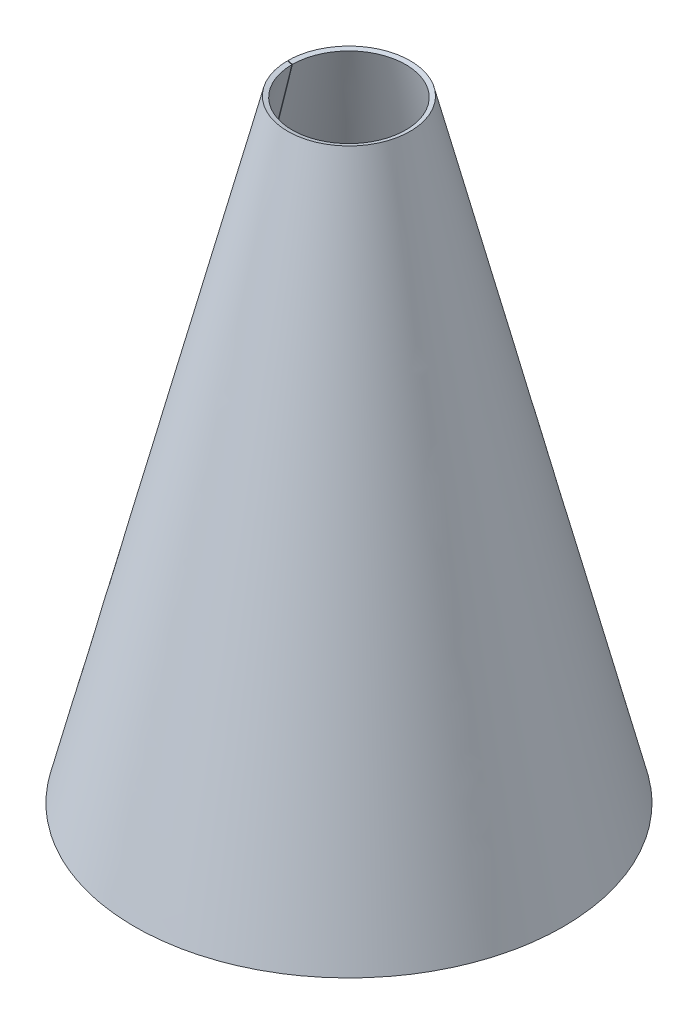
ISO-10303-21;
HEADER;
FILE_DESCRIPTION(('STEP AP214'),'2;1');
FILE_NAME('part.step','',(''),(''),'','','');
FILE_SCHEMA(('AUTOMOTIVE_DESIGN { 1 0 10303 214 1 1 1 1 }'));
ENDSEC;
DATA;
#1=APPLICATION_CONTEXT('core data for automotive mechanical design processes');
#2=APPLICATION_PROTOCOL_DEFINITION('international standard','automotive_design',2000,#1);
#3=PRODUCT_CONTEXT('',#1,'mechanical');
#4=PRODUCT('Part','Part','',(#3));
#5=PRODUCT_RELATED_PRODUCT_CATEGORY('part','',(#4));
#6=PRODUCT_DEFINITION_FORMATION('','',#4);
#7=PRODUCT_DEFINITION_CONTEXT('part definition',#1,'design');
#8=PRODUCT_DEFINITION('design','',#6,#7);
#9=PRODUCT_DEFINITION_SHAPE('','',#8);
#10=(LENGTH_UNIT() NAMED_UNIT(*) SI_UNIT(.MILLI.,.METRE.));
#11=(NAMED_UNIT(*) PLANE_ANGLE_UNIT() SI_UNIT($,.RADIAN.));
#12=(NAMED_UNIT(*) SI_UNIT($,.STERADIAN.) SOLID_ANGLE_UNIT());
#13=UNCERTAINTY_MEASURE_WITH_UNIT(LENGTH_MEASURE(1.E-05),#10,'distance_accuracy_value','');
#14=(GEOMETRIC_REPRESENTATION_CONTEXT(3) GLOBAL_UNCERTAINTY_ASSIGNED_CONTEXT((#13)) GLOBAL_UNIT_ASSIGNED_CONTEXT((#10,
#11,#12)) REPRESENTATION_CONTEXT('',''));
#15=CARTESIAN_POINT('',(0.,0.,0.));
#16=DIRECTION('',(0.,0.,1.));
#17=DIRECTION('',(1.,0.,0.));
#18=AXIS2_PLACEMENT_3D('',#15,#16,#17);
#19=CARTESIAN_POINT('',(-68.5447165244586,-0.363804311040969,0.0979211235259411));
#20=CARTESIAN_POINT('',(-68.5383108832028,-0.363804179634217,4.58184243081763));
#21=CARTESIAN_POINT('',(-68.0905023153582,-0.363812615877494,9.06598264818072));
#22=CARTESIAN_POINT('',(-66.3292820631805,-0.363810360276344,17.8590173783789));
#23=CARTESIAN_POINT('',(-65.0155043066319,-0.363800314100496,22.1697355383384));
#24=CARTESIAN_POINT('',(-61.573323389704,-0.363799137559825,30.4505563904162));
#25=CARTESIAN_POINT('',(-59.4442221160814,-0.363808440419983,34.4223393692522));
#26=CARTESIAN_POINT('',(-54.4533754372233,-0.363808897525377,41.8729479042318));
#27=CARTESIAN_POINT('',(-51.5906068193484,-0.363800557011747,45.3533009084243));
#28=CARTESIAN_POINT('',(-45.2426622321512,-0.363800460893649,51.6876559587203));
#29=CARTESIAN_POINT('',(-41.7561898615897,-0.363809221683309,54.5429519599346));
#30=CARTESIAN_POINT('',(-34.2948993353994,-0.363808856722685,59.5178376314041));
#31=CARTESIAN_POINT('',(-30.3185553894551,-0.363800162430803,61.6384446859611));
#32=CARTESIAN_POINT('',(-22.030378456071,-0.363800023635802,65.0628546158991));
#33=CARTESIAN_POINT('',(-17.7168507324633,-0.363808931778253,66.367357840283));
#34=CARTESIAN_POINT('',(-8.9200159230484,-0.363808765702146,68.1098105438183));
#35=CARTESIAN_POINT('',(-4.43491079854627,-0.363800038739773,68.548116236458));
#36=CARTESIAN_POINT('',(4.53283280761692,-0.363799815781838,68.5417107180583));
#37=CARTESIAN_POINT('',(9.01730538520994,-0.363808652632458,68.0969982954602));
#38=CARTESIAN_POINT('',(17.8116427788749,-0.363808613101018,66.3419802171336));
#39=CARTESIAN_POINT('',(22.1233050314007,-0.363800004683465,65.0313159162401));
#40=CARTESIAN_POINT('',(30.4065795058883,-0.363799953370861,61.5950696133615));
#41=CARTESIAN_POINT('',(34.3798859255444,-0.363808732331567,59.4687848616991));
#42=CARTESIAN_POINT('',(41.8340657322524,-0.363808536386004,54.4832440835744));
#43=CARTESIAN_POINT('',(45.3164625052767,-0.363799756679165,51.6229692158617));
#44=CARTESIAN_POINT('',(51.6553440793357,-0.363799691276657,45.2795548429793));
#45=CARTESIAN_POINT('',(54.513125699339,-0.363808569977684,41.7951176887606));
#46=CARTESIAN_POINT('',(59.4933371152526,-0.363808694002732,34.3373806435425));
#47=CARTESIAN_POINT('',(61.6167842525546,-0.363800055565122,30.3625572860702));
#48=CARTESIAN_POINT('',(65.0471054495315,-0.363799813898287,22.0768423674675));
#49=CARTESIAN_POINT('',(66.3546816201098,-0.363808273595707,17.7642551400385));
#50=CARTESIAN_POINT('',(68.1034127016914,-0.363807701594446,8.96867006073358));
#51=CARTESIAN_POINT('',(68.5449246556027,-0.363798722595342,4.48387605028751));
#52=CARTESIAN_POINT('',(68.5449246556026,-0.363798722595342,-4.48387605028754));
#53=CARTESIAN_POINT('',(68.1034127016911,-0.363807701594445,-8.96867006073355));
#54=CARTESIAN_POINT('',(66.3546816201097,-0.363808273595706,-17.7642551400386));
#55=CARTESIAN_POINT('',(65.0471054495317,-0.363799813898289,-22.0768423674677));
#56=CARTESIAN_POINT('',(61.616784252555,-0.363800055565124,-30.3625572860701));
#57=CARTESIAN_POINT('',(59.4933371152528,-0.363808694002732,-34.3373806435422));
#58=CARTESIAN_POINT('',(54.5131256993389,-0.363808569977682,-41.7951176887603));
#59=CARTESIAN_POINT('',(51.6553440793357,-0.363799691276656,-45.2795548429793));
#60=CARTESIAN_POINT('',(45.3164625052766,-0.363799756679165,-51.6229692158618));
#61=CARTESIAN_POINT('',(41.8340657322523,-0.363808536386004,-54.4832440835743));
#62=CARTESIAN_POINT('',(34.3798859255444,-0.363808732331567,-59.468784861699));
#63=CARTESIAN_POINT('',(30.4065795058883,-0.363799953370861,-61.5950696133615));
#64=CARTESIAN_POINT('',(22.1233050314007,-0.363800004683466,-65.0313159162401));
#65=CARTESIAN_POINT('',(17.811642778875,-0.363808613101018,-66.3419802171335));
#66=CARTESIAN_POINT('',(9.01730538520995,-0.363808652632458,-68.0969982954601));
#67=CARTESIAN_POINT('',(4.53283280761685,-0.363799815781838,-68.5417107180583));
#68=CARTESIAN_POINT('',(-4.43491079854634,-0.363800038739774,-68.5481162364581));
#69=CARTESIAN_POINT('',(-8.92001592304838,-0.363808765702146,-68.1098105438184));
#70=CARTESIAN_POINT('',(-17.7168507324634,-0.363808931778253,-66.3673578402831));
#71=CARTESIAN_POINT('',(-22.0303784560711,-0.363800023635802,-65.0628546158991));
#72=CARTESIAN_POINT('',(-30.3185553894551,-0.363800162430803,-61.638444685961));
#73=CARTESIAN_POINT('',(-34.2948993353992,-0.363808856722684,-59.517837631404));
#74=CARTESIAN_POINT('',(-41.7561898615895,-0.363809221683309,-54.5429519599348));
#75=CARTESIAN_POINT('',(-45.2426622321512,-0.363800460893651,-51.6876559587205));
#76=CARTESIAN_POINT('',(-51.5906068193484,-0.363800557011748,-45.3533009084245));
#77=CARTESIAN_POINT('',(-54.4533754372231,-0.363808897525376,-41.8729479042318));
#78=CARTESIAN_POINT('',(-59.4442221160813,-0.363808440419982,-34.4223393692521));
#79=CARTESIAN_POINT('',(-61.5733233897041,-0.363799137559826,-30.4505563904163));
#80=CARTESIAN_POINT('',(-65.015504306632,-0.363800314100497,-22.1697355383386));
#81=CARTESIAN_POINT('',(-66.3292820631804,-0.363810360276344,-17.859017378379));
#82=CARTESIAN_POINT('',(-68.0905023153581,-0.363812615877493,-9.06598264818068));
#83=CARTESIAN_POINT('',(-68.5383108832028,-0.363804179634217,-4.58184243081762));
#84=CARTESIAN_POINT('',(-68.5447165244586,-0.363804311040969,-0.0979211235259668));
#85=CARTESIAN_POINT('',(-69.9999285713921,0.,0.100000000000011));
#86=CARTESIAN_POINT('',(-69.9933865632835,0.,4.67940100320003));
#87=CARTESIAN_POINT('',(-69.536133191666,0.,9.25811872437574));
#88=CARTESIAN_POINT('',(-67.7373930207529,0.,18.238477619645));
#89=CARTESIAN_POINT('',(-66.3959062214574,0.,22.6401187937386));
#90=CARTESIAN_POINT('',(-62.8804110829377,0.,31.0973117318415));
#91=CARTESIAN_POINT('',(-60.7064027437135,0.,35.152863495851));
#92=CARTESIAN_POINT('',(-55.6092476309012,0.,42.7621748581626));
#93=CARTESIAN_POINT('',(-52.6861008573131,0.,46.3159344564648));
#94=CARTESIAN_POINT('',(-46.202945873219,0.,52.7852104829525));
#95=CARTESIAN_POINT('',(-42.6429376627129,0.,55.700726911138));
#96=CARTESIAN_POINT('',(-35.0227201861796,0.,60.7815787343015));
#97=CARTESIAN_POINT('',(-30.9625109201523,0.,62.9469141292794));
#98=CARTESIAN_POINT('',(-22.4977950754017,0.,66.4442643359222));
#99=CARTESIAN_POINT('',(-18.0932884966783,0.,67.7762791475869));
#100=CARTESIAN_POINT('',(-9.10908017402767,0.,69.5558463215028));
#101=CARTESIAN_POINT('',(-4.52937843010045,0.,70.0033986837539));
#102=CARTESIAN_POINT('',(4.6293792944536,0.,69.9968567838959));
#103=CARTESIAN_POINT('',(9.20843527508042,0.,69.5427625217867));
#104=CARTESIAN_POINT('',(18.1900928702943,0.,67.7503624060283));
#105=CARTESIAN_POINT('',(22.5926944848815,0.,66.4120565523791));
#106=CARTESIAN_POINT('',(31.0524038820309,0.,62.902617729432));
#107=CARTESIAN_POINT('',(35.1095116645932,0.,60.7314847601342));
#108=CARTESIAN_POINT('',(42.7224660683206,0.,55.6397516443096));
#109=CARTESIAN_POINT('',(46.2783126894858,0.,52.7191514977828));
#110=CARTESIAN_POINT('',(52.7522136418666,0.,46.240621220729));
#111=CARTESIAN_POINT('',(55.6702679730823,0.,42.682691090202));
#112=CARTESIAN_POINT('',(60.7565577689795,0.,35.0661043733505));
#113=CARTESIAN_POINT('',(62.924793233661,0.,31.007447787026));
#114=CARTESIAN_POINT('',(66.4281814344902,0.,22.5452444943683));
#115=CARTESIAN_POINT('',(67.7633341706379,0.,18.1416977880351));
#116=CARTESIAN_POINT('',(69.549313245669,0.,9.15876738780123));
#117=CARTESIAN_POINT('',(70.0001395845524,0.,4.57938369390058));
#118=CARTESIAN_POINT('',(70.0001395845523,0.,-4.57938369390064));
#119=CARTESIAN_POINT('',(69.5493132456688,0.,-9.15876738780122));
#120=CARTESIAN_POINT('',(67.7633341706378,0.,-18.1416977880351));
#121=CARTESIAN_POINT('',(66.4281814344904,0.,-22.5452444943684));
#122=CARTESIAN_POINT('',(62.9247932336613,0.,-31.007447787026));
#123=CARTESIAN_POINT('',(60.7565577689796,0.,-35.0661043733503));
#124=CARTESIAN_POINT('',(55.6702679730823,0.,-42.6826910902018));
#125=CARTESIAN_POINT('',(52.7522136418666,0.,-46.240621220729));
#126=CARTESIAN_POINT('',(46.2783126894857,0.,-52.7191514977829));
#127=CARTESIAN_POINT('',(42.7224660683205,0.,-55.6397516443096));
#128=CARTESIAN_POINT('',(35.1095116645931,0.,-60.7314847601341));
#129=CARTESIAN_POINT('',(31.0524038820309,0.,-62.902617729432));
#130=CARTESIAN_POINT('',(22.5926944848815,0.,-66.4120565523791));
#131=CARTESIAN_POINT('',(18.1900928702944,0.,-67.7503624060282));
#132=CARTESIAN_POINT('',(9.20843527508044,0.,-69.5427625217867));
#133=CARTESIAN_POINT('',(4.62937929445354,0.,-69.9968567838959));
#134=CARTESIAN_POINT('',(-4.52937843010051,0.,-70.003398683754));
#135=CARTESIAN_POINT('',(-9.10908017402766,0.,-69.5558463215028));
#136=CARTESIAN_POINT('',(-18.0932884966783,0.,-67.7762791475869));
#137=CARTESIAN_POINT('',(-22.4977950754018,0.,-66.4442643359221));
#138=CARTESIAN_POINT('',(-30.9625109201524,0.,-62.9469141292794));
#139=CARTESIAN_POINT('',(-35.0227201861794,0.,-60.7815787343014));
#140=CARTESIAN_POINT('',(-42.6429376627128,0.,-55.7007269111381));
#141=CARTESIAN_POINT('',(-46.202945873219,0.,-52.7852104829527));
#142=CARTESIAN_POINT('',(-52.6861008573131,0.,-46.315934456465));
#143=CARTESIAN_POINT('',(-55.609247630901,0.,-42.7621748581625));
#144=CARTESIAN_POINT('',(-60.7064027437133,0.,-35.1528634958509));
#145=CARTESIAN_POINT('',(-62.8804110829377,0.,-31.0973117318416));
#146=CARTESIAN_POINT('',(-66.3959062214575,0.,-22.6401187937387));
#147=CARTESIAN_POINT('',(-67.7373930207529,0.,-18.2384776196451));
#148=CARTESIAN_POINT('',(-69.5361331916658,0.,-9.25811872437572));
#149=CARTESIAN_POINT('',(-69.9933865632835,0.,-4.67940100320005));
#150=CARTESIAN_POINT('',(-69.9999285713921,0.,-0.100000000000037));
#151=B_SPLINE_SURFACE_WITH_KNOTS('',1,3,((#19,#20,#21,#22,#23,#24,#25,#26,#27,#28,#29,#30,#31,
#32,#33,#34,#35,#36,#37,#38,#39,#40,#41,#42,#43,#44,#45,#46,#47,#48,#49,#50,#51,#52,#53,#54,#55,
#56,#57,#58,#59,#60,#61,#62,#63,#64,#65,#66,#67,#68,#69,#70,#71,#72,#73,#74,#75,#76,#77,#78,#79,
#80,#81,#82,#83,#84),(#85,#86,#87,#88,#89,#90,#91,#92,#93,#94,#95,#96,#97,#98,#99,#100,#101,
#102,#103,#104,#105,#106,#107,#108,#109,#110,#111,#112,#113,#114,#115,#116,#117,#118,#119,#120,
#121,#122,#123,#124,#125,#126,#127,#128,#129,#130,#131,#132,#133,#134,#135,#136,#137,#138,#139,
#140,#141,#142,#143,#144,#145,#146,#147,#148,#149,#150)),.UNSPECIFIED.,.F.,.F.,.F.,(2,2),(4,2,2,
2,2,2,2,2,2,2,2,2,2,2,2,2,2,2,2,2,2,2,2,2,2,2,2,2,2,2,2,2,4),(0.,1.),(0.,0.03125,0.0625,0.09375,
0.125,0.15625,0.1875,0.21875,0.25,0.28125,0.3125,0.34375,0.375,0.40625,0.4375,0.46875,0.5,
0.53125,0.5625,0.59375,0.625,0.65625,0.6875,0.71875,0.75,0.78125,0.8125,0.84375,0.875,0.90625,
0.9375,0.96875,1.),.UNSPECIFIED.);
#152=CARTESIAN_POINT('',(-69.9999285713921,0.,-0.100000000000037));
#153=CARTESIAN_POINT('',(-68.5447165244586,-0.363804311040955,-0.0979211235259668));
#154=B_SPLINE_CURVE_WITH_KNOTS('',1,(#152,#153),.UNSPECIFIED.,.F.,.F.,(2,2),(0.,1.),.UNSPECIFIED.);
#155=CARTESIAN_POINT('',(-69.9999285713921,0.,-0.100000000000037));
#156=VERTEX_POINT('',#155);
#157=CARTESIAN_POINT('',(-68.5447165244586,-0.363804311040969,-0.0979211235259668));
#158=VERTEX_POINT('',#157);
#159=EDGE_CURVE('E14',#156,#158,#154,.T.);
#160=CARTESIAN_POINT('',(-69.9999285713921,0.,-0.100000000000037));
#161=CARTESIAN_POINT('',(-69.9933865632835,0.,-4.67940100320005));
#162=CARTESIAN_POINT('',(-69.5361331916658,0.,-9.25811872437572));
#163=CARTESIAN_POINT('',(-67.7373930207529,0.,-18.2384776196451));
#164=CARTESIAN_POINT('',(-66.3959062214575,0.,-22.6401187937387));
#165=CARTESIAN_POINT('',(-62.8804110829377,0.,-31.0973117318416));
#166=CARTESIAN_POINT('',(-60.7064027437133,0.,-35.1528634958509));
#167=CARTESIAN_POINT('',(-55.609247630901,0.,-42.7621748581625));
#168=CARTESIAN_POINT('',(-52.6861008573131,0.,-46.315934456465));
#169=CARTESIAN_POINT('',(-46.202945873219,0.,-52.7852104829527));
#170=CARTESIAN_POINT('',(-42.6429376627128,0.,-55.7007269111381));
#171=CARTESIAN_POINT('',(-35.0227201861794,0.,-60.7815787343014));
#172=CARTESIAN_POINT('',(-30.9625109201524,0.,-62.9469141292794));
#173=CARTESIAN_POINT('',(-22.4977950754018,0.,-66.4442643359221));
#174=CARTESIAN_POINT('',(-18.0932884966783,0.,-67.7762791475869));
#175=CARTESIAN_POINT('',(-9.10908017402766,0.,-69.5558463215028));
#176=CARTESIAN_POINT('',(-4.52937843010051,0.,-70.003398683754));
#177=CARTESIAN_POINT('',(4.62937929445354,0.,-69.9968567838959));
#178=CARTESIAN_POINT('',(9.20843527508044,0.,-69.5427625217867));
#179=CARTESIAN_POINT('',(18.1900928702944,0.,-67.7503624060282));
#180=CARTESIAN_POINT('',(22.5926944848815,0.,-66.4120565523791));
#181=CARTESIAN_POINT('',(31.0524038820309,0.,-62.902617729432));
#182=CARTESIAN_POINT('',(35.1095116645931,0.,-60.7314847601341));
#183=CARTESIAN_POINT('',(42.7224660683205,0.,-55.6397516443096));
#184=CARTESIAN_POINT('',(46.2783126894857,0.,-52.7191514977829));
#185=CARTESIAN_POINT('',(52.7522136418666,0.,-46.240621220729));
#186=CARTESIAN_POINT('',(55.6702679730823,0.,-42.6826910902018));
#187=CARTESIAN_POINT('',(60.7565577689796,0.,-35.0661043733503));
#188=CARTESIAN_POINT('',(62.9247932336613,0.,-31.007447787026));
#189=CARTESIAN_POINT('',(66.4281814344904,0.,-22.5452444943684));
#190=CARTESIAN_POINT('',(67.7633341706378,0.,-18.1416977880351));
#191=CARTESIAN_POINT('',(69.5493132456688,0.,-9.15876738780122));
#192=CARTESIAN_POINT('',(70.0001395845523,0.,-4.57938369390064));
#193=CARTESIAN_POINT('',(70.0001395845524,0.,4.57938369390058));
#194=CARTESIAN_POINT('',(69.549313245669,0.,9.15876738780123));
#195=CARTESIAN_POINT('',(67.7633341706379,0.,18.1416977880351));
#196=CARTESIAN_POINT('',(66.4281814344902,0.,22.5452444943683));
#197=CARTESIAN_POINT('',(62.924793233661,0.,31.007447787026));
#198=CARTESIAN_POINT('',(60.7565577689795,0.,35.0661043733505));
#199=CARTESIAN_POINT('',(55.6702679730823,0.,42.682691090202));
#200=CARTESIAN_POINT('',(52.7522136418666,0.,46.240621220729));
#201=CARTESIAN_POINT('',(46.2783126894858,0.,52.7191514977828));
#202=CARTESIAN_POINT('',(42.7224660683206,0.,55.6397516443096));
#203=CARTESIAN_POINT('',(35.1095116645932,0.,60.7314847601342));
#204=CARTESIAN_POINT('',(31.0524038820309,0.,62.902617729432));
#205=CARTESIAN_POINT('',(22.5926944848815,0.,66.4120565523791));
#206=CARTESIAN_POINT('',(18.1900928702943,0.,67.7503624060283));
#207=CARTESIAN_POINT('',(9.20843527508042,0.,69.5427625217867));
#208=CARTESIAN_POINT('',(4.6293792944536,0.,69.9968567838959));
#209=CARTESIAN_POINT('',(-4.52937843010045,0.,70.0033986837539));
#210=CARTESIAN_POINT('',(-9.10908017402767,0.,69.5558463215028));
#211=CARTESIAN_POINT('',(-18.0932884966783,0.,67.7762791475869));
#212=CARTESIAN_POINT('',(-22.4977950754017,0.,66.4442643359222));
#213=CARTESIAN_POINT('',(-30.9625109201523,0.,62.9469141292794));
#214=CARTESIAN_POINT('',(-35.0227201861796,0.,60.7815787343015));
#215=CARTESIAN_POINT('',(-42.6429376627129,0.,55.700726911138));
#216=CARTESIAN_POINT('',(-46.202945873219,0.,52.7852104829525));
#217=CARTESIAN_POINT('',(-52.6861008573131,0.,46.3159344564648));
#218=CARTESIAN_POINT('',(-55.6092476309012,0.,42.7621748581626));
#219=CARTESIAN_POINT('',(-60.7064027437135,0.,35.152863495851));
#220=CARTESIAN_POINT('',(-62.8804110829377,0.,31.0973117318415));
#221=CARTESIAN_POINT('',(-66.3959062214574,0.,22.6401187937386));
#222=CARTESIAN_POINT('',(-67.7373930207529,0.,18.238477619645));
#223=CARTESIAN_POINT('',(-69.536133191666,0.,9.25811872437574));
#224=CARTESIAN_POINT('',(-69.9933865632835,0.,4.67940100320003));
#225=CARTESIAN_POINT('',(-69.9999285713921,0.,0.100000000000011));
#226=B_SPLINE_CURVE_WITH_KNOTS('',3,(#160,#161,#162,#163,#164,#165,#166,#167,#168,#169,#170,
#171,#172,#173,#174,#175,#176,#177,#178,#179,#180,#181,#182,#183,#184,#185,#186,#187,#188,#189,
#190,#191,#192,#193,#194,#195,#196,#197,#198,#199,#200,#201,#202,#203,#204,#205,#206,#207,#208,
#209,#210,#211,#212,#213,#214,#215,#216,#217,#218,#219,#220,#221,#222,#223,#224,#225),
.UNSPECIFIED.,.F.,.F.,(4,2,2,2,2,2,2,2,2,2,2,2,2,2,2,2,2,2,2,2,2,2,2,2,2,2,2,2,2,2,2,2,4),(0.,
0.03125,0.0625,0.09375,0.125,0.15625,0.1875,0.21875,0.25,0.28125,0.3125,0.34375,0.375,0.40625,
0.4375,0.46875,0.5,0.53125,0.5625,0.59375,0.625,0.65625,0.6875,0.71875,0.75,0.78125,0.8125,
0.84375,0.875,0.90625,0.9375,0.96875,1.),.UNSPECIFIED.);
#227=CARTESIAN_POINT('',(-69.9999285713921,0.,0.100000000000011));
#228=VERTEX_POINT('',#227);
#229=EDGE_CURVE('E276',#156,#228,#226,.T.);
#230=CARTESIAN_POINT('',(-69.9999285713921,0.,0.100000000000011));
#231=CARTESIAN_POINT('',(-68.5447165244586,-0.363804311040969,0.0979211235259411));
#232=B_SPLINE_CURVE_WITH_KNOTS('',1,(#230,#231),.UNSPECIFIED.,.F.,.F.,(2,2),(0.,1.),.UNSPECIFIED.);
#233=CARTESIAN_POINT('',(-68.5447165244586,-0.363804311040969,0.0979211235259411));
#234=VERTEX_POINT('',#233);
#235=EDGE_CURVE('E109',#228,#234,#232,.T.);
#236=CARTESIAN_POINT('',(-68.5447165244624,-0.363804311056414,-0.0979211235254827));
#237=CARTESIAN_POINT('',(-68.5431143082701,-0.363804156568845,-1.21895161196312));
#238=CARTESIAN_POINT('',(-68.5139289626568,-0.36380432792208,-2.3399347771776));
#239=CARTESIAN_POINT('',(-68.400653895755,-0.363805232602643,-4.579184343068));
#240=CARTESIAN_POINT('',(-68.3165612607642,-0.363805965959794,-5.69745059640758));
#241=CARTESIAN_POINT('',(-68.0937342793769,-0.363807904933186,-7.92851910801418));
#242=CARTESIAN_POINT('',(-67.9550002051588,-0.363809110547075,-9.0413213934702));
#243=CARTESIAN_POINT('',(-67.6231587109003,-0.363811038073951,-11.2587220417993));
#244=CARTESIAN_POINT('',(-67.430054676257,-0.363811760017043,-12.3633209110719));
#245=CARTESIAN_POINT('',(-66.9897294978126,-0.363811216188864,-14.5616801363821));
#246=CARTESIAN_POINT('',(-66.7425083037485,-0.363809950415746,-15.655440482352));
#247=CARTESIAN_POINT('',(-66.1947320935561,-0.363807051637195,-17.8295921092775));
#248=CARTESIAN_POINT('',(-65.8941737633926,-0.363805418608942,-18.9099825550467));
#249=CARTESIAN_POINT('',(-65.2405235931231,-0.363802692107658,-21.0547556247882));
#250=CARTESIAN_POINT('',(-64.8874316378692,-0.36380159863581,-22.1191382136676));
#251=CARTESIAN_POINT('',(-64.1295211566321,-0.363800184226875,-24.2292584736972));
#252=CARTESIAN_POINT('',(-63.7247056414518,-0.363799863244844,-25.2749972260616));
#253=CARTESIAN_POINT('',(-62.8641223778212,-0.363799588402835,-27.3452939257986));
#254=CARTESIAN_POINT('',(-62.4083546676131,-0.363799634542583,-28.3698518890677));
#255=CARTESIAN_POINT('',(-61.4471250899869,-0.363800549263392,-30.3954541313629));
#256=CARTESIAN_POINT('',(-60.9416603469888,-0.363801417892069,-31.3964970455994));
#257=CARTESIAN_POINT('',(-59.8823316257,-0.363803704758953,-33.3726369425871));
#258=CARTESIAN_POINT('',(-59.3284676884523,-0.363805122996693,-34.3477339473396));
#259=CARTESIAN_POINT('',(-58.1736416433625,-0.363807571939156,-36.269552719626));
#260=CARTESIAN_POINT('',(-57.5726823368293,-0.363808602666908,-37.216276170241));
#261=CARTESIAN_POINT('',(-56.3249146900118,-0.363808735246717,-39.0790118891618));
#262=CARTESIAN_POINT('',(-55.6781063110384,-0.363807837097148,-39.9950241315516));
#263=CARTESIAN_POINT('',(-54.3403307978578,-0.363805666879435,-41.7942962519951));
#264=CARTESIAN_POINT('',(-53.6493610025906,-0.363804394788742,-42.6775541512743));
#265=CARTESIAN_POINT('',(-52.2250092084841,-0.363802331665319,-44.4091846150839));
#266=CARTESIAN_POINT('',(-51.4916271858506,-0.36380154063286,-45.2575571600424));
#267=CARTESIAN_POINT('',(-49.9842029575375,-0.363800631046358,-46.9172880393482));
#268=CARTESIAN_POINT('',(-49.2101631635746,-0.363800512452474,-47.728648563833));
#269=CARTESIAN_POINT('',(-47.623106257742,-0.363800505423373,-49.3123079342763));
#270=CARTESIAN_POINT('',(-46.8100891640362,-0.363800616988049,-50.0846067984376));
#271=CARTESIAN_POINT('',(-45.1471327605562,-0.363801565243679,-51.5884697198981));
#272=CARTESIAN_POINT('',(-44.297191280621,-0.363802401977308,-52.3200313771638));
#273=CARTESIAN_POINT('',(-42.5625138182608,-0.363804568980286,-53.7406683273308));
#274=CARTESIAN_POINT('',(-41.6777778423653,-0.363805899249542,-54.429743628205));
#275=CARTESIAN_POINT('',(-39.8756436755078,-0.363808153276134,-55.7636613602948));
#276=CARTESIAN_POINT('',(-38.9582474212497,-0.363809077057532,-56.4085064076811));
#277=CARTESIAN_POINT('',(-37.0928413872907,-0.363809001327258,-57.6522834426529));
#278=CARTESIAN_POINT('',(-36.1448315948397,-0.363808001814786,-58.251215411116));
#279=CARTESIAN_POINT('',(-34.2205408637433,-0.363805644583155,-59.4019264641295));
#280=CARTESIAN_POINT('',(-33.2442582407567,-0.363804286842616,-59.953702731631));
#281=CARTESIAN_POINT('',(-31.2658510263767,-0.363802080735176,-61.0087995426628));
#282=CARTESIAN_POINT('',(-30.2637264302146,-0.36380123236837,-61.5121200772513));
#283=CARTESIAN_POINT('',(-28.2360679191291,-0.363800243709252,-62.4690084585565));
#284=CARTESIAN_POINT('',(-27.2105353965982,-0.363800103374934,-62.9225792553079));
#285=CARTESIAN_POINT('',(-25.1383986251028,-0.363800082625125,-63.7787199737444));
#286=CARTESIAN_POINT('',(-24.0917943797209,-0.363800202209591,-64.1812899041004));
#287=CARTESIAN_POINT('',(-21.9800530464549,-0.36380117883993,-64.9346693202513));
#288=CARTESIAN_POINT('',(-20.9149148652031,-0.363802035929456,-65.2854757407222));
#289=CARTESIAN_POINT('',(-18.768741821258,-0.363804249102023,-65.9345237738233));
#290=CARTESIAN_POINT('',(-17.6877069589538,-0.36380560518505,-66.2327653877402));
#291=CARTESIAN_POINT('',(-15.5123790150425,-0.363807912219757,-66.775885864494));
#292=CARTESIAN_POINT('',(-14.4180867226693,-0.363808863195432,-67.0207678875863));
#293=CARTESIAN_POINT('',(-12.2187797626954,-0.363808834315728,-67.4564005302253));
#294=CARTESIAN_POINT('',(-11.113765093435,-0.363807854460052,-67.647151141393));
#295=CARTESIAN_POINT('',(-8.89565184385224,-0.363805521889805,-67.9742713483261));
#296=CARTESIAN_POINT('',(-7.78255278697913,-0.363804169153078,-68.1106377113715));
#297=CARTESIAN_POINT('',(-5.55101342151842,-0.363801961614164,-68.3287148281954));
#298=CARTESIAN_POINT('',(-4.43257311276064,-0.363801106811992,-68.4104255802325));
#299=CARTESIAN_POINT('',(-2.19309485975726,-0.363800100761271,-68.5189236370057));
#300=CARTESIAN_POINT('',(-1.07205707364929,-0.36379994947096,-68.5457142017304));
#301=CARTESIAN_POINT('',(1.16997898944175,-0.363799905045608,-68.5441127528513));
#302=CARTESIAN_POINT('',(2.2909772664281,-0.363800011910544,-68.5157207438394));
#303=CARTESIAN_POINT('',(4.53029794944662,-0.363800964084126,-68.404023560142));
#304=CARTESIAN_POINT('',(5.6486201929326,-0.36380180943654,-68.3207151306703));
#305=CARTESIAN_POINT('',(7.87984537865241,-0.363804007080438,-68.0994503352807));
#306=CARTESIAN_POINT('',(8.9927483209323,-0.363805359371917,-67.9614939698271));
#307=CARTESIAN_POINT('',(11.2103918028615,-0.363807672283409,-67.6312053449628));
#308=CARTESIAN_POINT('',(12.3151328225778,-0.363808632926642,-67.4388763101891));
#309=CARTESIAN_POINT('',(14.5138153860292,-0.363808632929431,-67.0001021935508));
#310=CARTESIAN_POINT('',(15.6077569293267,-0.36380767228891,-66.753657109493));
#311=CARTESIAN_POINT('',(17.7823072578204,-0.363805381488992,-66.2074295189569));
#312=CARTESIAN_POINT('',(18.8629152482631,-0.363804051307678,-65.9076438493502));
#313=CARTESIAN_POINT('',(21.0081593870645,-0.363801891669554,-65.2555304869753));
#314=CARTESIAN_POINT('',(22.0727955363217,-0.363801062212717,-64.9032027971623));
#315=CARTESIAN_POINT('',(24.1834586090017,-0.363800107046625,-64.1468074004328));
#316=CARTESIAN_POINT('',(25.2294866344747,-0.363799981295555,-63.7427427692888));
#317=CARTESIAN_POINT('',(27.3003977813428,-0.363799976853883,-62.88364281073));
#318=CARTESIAN_POINT('',(28.3252809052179,-0.363800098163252,-62.4286074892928));
#319=CARTESIAN_POINT('',(30.3515694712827,-0.363801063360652,-61.4688235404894));
#320=CARTESIAN_POINT('',(31.3529735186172,-0.363801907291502,-60.964071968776));
#321=CARTESIAN_POINT('',(33.3298706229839,-0.363804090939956,-59.9061500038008));
#322=CARTESIAN_POINT('',(34.3053636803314,-0.363805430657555,-59.3529796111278));
#323=CARTESIAN_POINT('',(36.2280084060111,-0.363807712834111,-58.1995206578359));
#324=CARTESIAN_POINT('',(37.1751617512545,-0.363808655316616,-57.599234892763));
#325=CARTESIAN_POINT('',(39.0387899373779,-0.363808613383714,-56.3527940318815));
#326=CARTESIAN_POINT('',(39.9552647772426,-0.363807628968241,-55.7066389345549));
#327=CARTESIAN_POINT('',(41.7554931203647,-0.363805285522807,-54.3701478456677));
#328=CARTESIAN_POINT('',(42.6392446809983,-0.363803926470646,-53.679809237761));
#329=CARTESIAN_POINT('',(44.3718922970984,-0.363801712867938,-52.2566955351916));
#330=CARTESIAN_POINT('',(45.2207883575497,-0.363800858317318,-51.5239204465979));
#331=CARTESIAN_POINT('',(46.881594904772,-0.36379986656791,-50.0176836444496));
#332=CARTESIAN_POINT('',(47.6935075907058,-0.363799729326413,-49.2442243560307));
#333=CARTESIAN_POINT('',(49.2782988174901,-0.363799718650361,-47.6582998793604));
#334=CARTESIAN_POINT('',(50.0511773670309,-0.363799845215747,-46.8458346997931));
#335=CARTESIAN_POINT('',(51.5562260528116,-0.363800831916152,-45.1839525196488));
#336=CARTESIAN_POINT('',(52.2883937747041,-0.363801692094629,-44.3345333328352));
#337=CARTESIAN_POINT('',(53.7102678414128,-0.363803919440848,-42.6008699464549));
#338=CARTESIAN_POINT('',(54.3999741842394,-0.363805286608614,-41.7166257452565));
#339=CARTESIAN_POINT('',(55.7351775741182,-0.363807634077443,-39.9154437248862));
#340=CARTESIAN_POINT('',(56.3806772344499,-0.363808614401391,-38.9985078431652));
#341=CARTESIAN_POINT('',(57.6257856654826,-0.363808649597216,-37.13399036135));
#342=CARTESIAN_POINT('',(58.2253944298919,-0.363807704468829,-36.1864087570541));
#343=CARTESIAN_POINT('',(59.3774792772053,-0.36380542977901,-34.2629413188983));
#344=CARTESIAN_POINT('',(59.9299525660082,-0.363804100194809,-33.2870538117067));
#345=CARTESIAN_POINT('',(60.9864616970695,-0.363801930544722,-31.309402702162));
#346=CARTESIAN_POINT('',(61.4904975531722,-0.363801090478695,-30.3076391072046));
#347=CARTESIAN_POINT('',(62.4488329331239,-0.363800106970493,-28.2806674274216));
#348=CARTESIAN_POINT('',(62.9031354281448,-0.36379996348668,-27.2554607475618));
#349=CARTESIAN_POINT('',(63.7607540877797,-0.363799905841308,-25.18393935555));
#350=CARTESIAN_POINT('',(64.1640702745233,-0.363799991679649,-24.1376246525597));
#351=CARTESIAN_POINT('',(64.9189552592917,-0.363800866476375,-22.0264253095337));
#352=CARTESIAN_POINT('',(65.2705209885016,-0.363801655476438,-20.9615395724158));
#353=CARTESIAN_POINT('',(65.921099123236,-0.363803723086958,-18.8158335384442));
#354=CARTESIAN_POINT('',(66.2201115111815,-0.363805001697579,-17.7350132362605));
#355=CARTESIAN_POINT('',(66.7647834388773,-0.363807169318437,-15.5600757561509));
#356=CARTESIAN_POINT('',(67.010446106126,-0.363808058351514,-14.4659593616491));
#357=CARTESIAN_POINT('',(67.4476483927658,-0.363807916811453,-12.2669649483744));
#358=CARTESIAN_POINT('',(67.6391879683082,-0.363806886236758,-11.1620869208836));
#359=CARTESIAN_POINT('',(67.9678923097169,-0.363804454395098,-8.94420768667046));
#360=CARTESIAN_POINT('',(68.1050538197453,-0.363803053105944,-7.83120599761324));
#361=CARTESIAN_POINT('',(68.3247252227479,-0.363800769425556,-5.59982204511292));
#362=CARTESIAN_POINT('',(68.4072350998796,-0.363799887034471,-4.4814397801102));
#363=CARTESIAN_POINT('',(68.5173331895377,-0.363798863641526,-2.24203823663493));
#364=CARTESIAN_POINT('',(68.5449246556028,-0.363798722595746,-1.12101911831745));
#365=CARTESIAN_POINT('',(68.5449246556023,-0.363798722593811,1.12101911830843));
#366=CARTESIAN_POINT('',(68.5173331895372,-0.363798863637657,2.24203823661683));
#367=CARTESIAN_POINT('',(68.4072350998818,-0.36379988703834,4.48143978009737));
#368=CARTESIAN_POINT('',(68.3247252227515,-0.3638007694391,5.59982204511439));
#369=CARTESIAN_POINT('',(68.1050538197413,-0.3638030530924,7.83120599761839));
#370=CARTESIAN_POINT('',(67.967892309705,-0.36380445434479,8.94420768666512));
#371=CARTESIAN_POINT('',(67.6391879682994,-0.363806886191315,11.1620869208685));
#372=CARTESIAN_POINT('',(67.4476483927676,-0.363807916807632,12.26696494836));
#373=CARTESIAN_POINT('',(67.0104461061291,-0.363808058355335,14.4659593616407));
#374=CARTESIAN_POINT('',(66.7647834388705,-0.363807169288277,15.5600757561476));
#375=CARTESIAN_POINT('',(66.2201115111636,-0.363805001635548,17.7350132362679));
#376=CARTESIAN_POINT('',(65.9210991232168,-0.36380372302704,18.8158335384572));
#377=CARTESIAN_POINT('',(65.2705209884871,-0.363801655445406,20.961539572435));
#378=CARTESIAN_POINT('',(64.9189552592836,-0.363800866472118,22.0264253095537));
#379=CARTESIAN_POINT('',(64.1640702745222,-0.363799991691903,24.1376246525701));
#380=CARTESIAN_POINT('',(63.7607540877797,-0.363799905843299,25.1839393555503));
#381=CARTESIAN_POINT('',(62.9031354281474,-0.36379996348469,27.2554607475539));
#382=CARTESIAN_POINT('',(62.4488329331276,-0.363800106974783,28.2806674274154));
#383=CARTESIAN_POINT('',(61.4904975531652,-0.363801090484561,30.3076391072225));
#384=CARTESIAN_POINT('',(60.9864616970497,-0.363801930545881,31.3094027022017));
#385=CARTESIAN_POINT('',(59.9299525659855,-0.363804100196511,33.2870538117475));
#386=CARTESIAN_POINT('',(59.3774792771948,-0.36380542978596,34.2629413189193));
#387=CARTESIAN_POINT('',(58.2253944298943,-0.363807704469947,36.1864087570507));
#388=CARTESIAN_POINT('',(57.625785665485,-0.363808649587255,37.1339903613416));
#389=CARTESIAN_POINT('',(56.3806772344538,-0.363808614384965,38.9985078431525));
#390=CARTESIAN_POINT('',(55.7351775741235,-0.363807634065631,39.915443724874));
#391=CARTESIAN_POINT('',(54.3999741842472,-0.363805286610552,41.7166257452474));
#392=CARTESIAN_POINT('',(53.7102678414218,-0.363803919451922,42.6008699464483));
#393=CARTESIAN_POINT('',(52.288393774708,-0.363801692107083,44.3345333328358));
#394=CARTESIAN_POINT('',(51.5562260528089,-0.363800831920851,45.1839525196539));
#395=CARTESIAN_POINT('',(50.0511773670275,-0.363799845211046,46.8458346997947));
#396=CARTESIAN_POINT('',(49.2782988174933,-0.363799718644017,47.6582998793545));
#397=CARTESIAN_POINT('',(47.6935075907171,-0.363799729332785,49.244224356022));
#398=CARTESIAN_POINT('',(46.8815949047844,-0.363799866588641,50.0176836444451));
#399=CARTESIAN_POINT('',(45.220788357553,-0.363800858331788,51.5239204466));
#400=CARTESIAN_POINT('',(44.3718922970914,-0.363801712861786,52.2566955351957));
#401=CARTESIAN_POINT('',(42.6392446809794,-0.363803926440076,53.6798092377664));
#402=CARTESIAN_POINT('',(41.7554931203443,-0.363805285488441,54.3701478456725));
#403=CARTESIAN_POINT('',(39.9552647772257,-0.363807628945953,55.7066389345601));
#404=CARTESIAN_POINT('',(39.0387899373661,-0.363808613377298,56.3527940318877));
#405=CARTESIAN_POINT('',(37.1751617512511,-0.36380865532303,57.599234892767));
#406=CARTESIAN_POINT('',(36.2280084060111,-0.363807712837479,58.1995206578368));
#407=CARTESIAN_POINT('',(34.3053636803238,-0.363805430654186,59.3529796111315));
#408=CARTESIAN_POINT('',(33.3298706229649,-0.363804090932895,59.9061500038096));
#409=CARTESIAN_POINT('',(31.3529735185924,-0.363801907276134,60.9640719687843));
#410=CARTESIAN_POINT('',(30.351569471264,-0.36380106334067,61.4688235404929));
#411=CARTESIAN_POINT('',(28.3252809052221,-0.363800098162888,62.4286074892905));
#412=CARTESIAN_POINT('',(27.3003977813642,-0.363799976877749,62.8836428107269));
#413=CARTESIAN_POINT('',(25.2294866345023,-0.363799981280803,63.7427427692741));
#414=CARTESIAN_POINT('',(24.183458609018,-0.363800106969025,64.146807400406));
#415=CARTESIAN_POINT('',(22.0727955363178,-0.36380106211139,64.9032027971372));
#416=CARTESIAN_POINT('',(21.0081593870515,-0.363801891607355,65.2555304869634));
#417=CARTESIAN_POINT('',(18.8629152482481,-0.363804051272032,65.907643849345));
#418=CARTESIAN_POINT('',(17.7823072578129,-0.363805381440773,66.2074295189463));
#419=CARTESIAN_POINT('',(15.6077569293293,-0.363807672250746,66.7536571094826));
#420=CARTESIAN_POINT('',(14.5138153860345,-0.363808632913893,67.0001021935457));
#421=CARTESIAN_POINT('',(12.3151328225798,-0.363808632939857,67.4388763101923));
#422=CARTESIAN_POINT('',(11.2103918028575,-0.363807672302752,67.6312053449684));
#423=CARTESIAN_POINT('',(8.99274832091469,-0.36380535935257,67.9614939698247));
#424=CARTESIAN_POINT('',(7.87984537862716,-0.36380400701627,68.0994503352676));
#425=CARTESIAN_POINT('',(5.64862019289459,-0.363801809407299,68.3207151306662));
#426=CARTESIAN_POINT('',(4.5302979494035,-0.363800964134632,68.4040235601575));
#427=CARTESIAN_POINT('',(2.29097726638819,-0.363800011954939,68.5157207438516));
#428=CARTESIAN_POINT('',(1.16997898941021,-0.363799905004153,68.5441127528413));
#429=CARTESIAN_POINT('',(-1.07205707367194,-0.363799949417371,68.5457142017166));
#430=CARTESIAN_POINT('',(-2.19309485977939,-0.363800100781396,68.5189236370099));
#431=CARTESIAN_POINT('',(-4.4325731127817,-0.363801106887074,68.4104255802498));
#432=CARTESIAN_POINT('',(-5.55101342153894,-0.363801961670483,68.3287148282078));
#433=CARTESIAN_POINT('',(-7.78255278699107,-0.363804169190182,68.1106377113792));
#434=CARTESIAN_POINT('',(-8.89565184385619,-0.363805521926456,67.9742713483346));
#435=CARTESIAN_POINT('',(-11.1137650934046,-0.363807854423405,67.6471511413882));
#436=CARTESIAN_POINT('',(-12.2187797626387,-0.36380883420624,67.4564005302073));
#437=CARTESIAN_POINT('',(-14.4180867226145,-0.363808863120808,67.0207678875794));
#438=CARTESIAN_POINT('',(-15.5123790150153,-0.363807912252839,66.7758858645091));
#439=CARTESIAN_POINT('',(-17.6877069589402,-0.363805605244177,66.2327653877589));
#440=CARTESIAN_POINT('',(-18.7687418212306,-0.363804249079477,65.9345237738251));
#441=CARTESIAN_POINT('',(-20.9149148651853,-0.363802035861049,65.2854757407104));
#442=CARTESIAN_POINT('',(-21.98005304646,-0.363801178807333,64.9346693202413));
#443=CARTESIAN_POINT('',(-24.0917943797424,-0.363800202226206,64.1812899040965));
#444=CARTESIAN_POINT('',(-25.1383986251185,-0.363800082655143,63.7787199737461));
#445=CARTESIAN_POINT('',(-27.2105353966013,-0.363800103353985,62.9225792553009));
#446=CARTESIAN_POINT('',(-28.2360679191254,-0.363800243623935,62.4690084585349));
#447=CARTESIAN_POINT('',(-30.2637264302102,-0.363801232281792,61.5121200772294));
#448=CARTESIAN_POINT('',(-31.2658510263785,-0.363802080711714,61.0087995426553));
#449=CARTESIAN_POINT('',(-33.2442582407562,-0.363804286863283,59.9537027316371));
#450=CARTESIAN_POINT('',(-34.2205408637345,-0.363805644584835,59.401926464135));
#451=CARTESIAN_POINT('',(-36.1448315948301,-0.363808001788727,58.2512154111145));
#452=CARTESIAN_POINT('',(-37.0928413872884,-0.363809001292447,57.6522834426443));
#453=CARTESIAN_POINT('',(-38.9582474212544,-0.36380907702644,56.4085064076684));
#454=CARTESIAN_POINT('',(-39.8756436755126,-0.363808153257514,55.7636613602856));
#455=CARTESIAN_POINT('',(-41.6777778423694,-0.363805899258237,54.4297436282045));
#456=CARTESIAN_POINT('',(-42.5625138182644,-0.363804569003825,53.7406683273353));
#457=CARTESIAN_POINT('',(-44.2971912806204,-0.36380240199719,52.3200313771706));
#458=CARTESIAN_POINT('',(-45.1471327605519,-0.363801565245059,51.5884697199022));
#459=CARTESIAN_POINT('',(-46.8100891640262,-0.363800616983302,50.084606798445));
#460=CARTESIAN_POINT('',(-47.62310625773,-0.363800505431,49.3123079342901));
#461=CARTESIAN_POINT('',(-49.2101631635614,-0.36380051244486,47.7286485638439));
#462=CARTESIAN_POINT('',(-49.9842029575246,-0.363800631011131,46.9172880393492));
#463=CARTESIAN_POINT('',(-51.4916271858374,-0.363801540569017,45.2575571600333));
#464=CARTESIAN_POINT('',(-52.2250092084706,-0.363802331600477,44.4091846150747));
#465=CARTESIAN_POINT('',(-53.6493610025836,-0.363804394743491,42.6775541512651));
#466=CARTESIAN_POINT('',(-54.3403307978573,-0.363805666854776,41.7942962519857));
#467=CARTESIAN_POINT('',(-55.6781063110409,-0.363807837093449,39.9950241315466));
#468=CARTESIAN_POINT('',(-56.324914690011,-0.363808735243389,39.0790118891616));
#469=CARTESIAN_POINT('',(-57.5726823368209,-0.363808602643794,37.2162761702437));
#470=CARTESIAN_POINT('',(-58.1736416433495,-0.363807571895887,36.2695527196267));
#471=CARTESIAN_POINT('',(-59.3284676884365,-0.363805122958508,34.3477339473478));
#472=CARTESIAN_POINT('',(-59.8823316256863,-0.363803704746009,33.3726369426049));
#473=CARTESIAN_POINT('',(-60.9416603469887,-0.36380141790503,31.3964970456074));
#474=CARTESIAN_POINT('',(-61.4471250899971,-0.363800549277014,30.3954541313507));
#475=CARTESIAN_POINT('',(-62.4083546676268,-0.36379963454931,28.3698518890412));
#476=CARTESIAN_POINT('',(-62.8641223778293,-0.363799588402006,27.3452939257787));
#477=CARTESIAN_POINT('',(-63.7247056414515,-0.363799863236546,25.2749972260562));
#478=CARTESIAN_POINT('',(-64.1295211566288,-0.363800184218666,24.2292584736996));
#479=CARTESIAN_POINT('',(-64.8874316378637,-0.363801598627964,22.1191382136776));
#480=CARTESIAN_POINT('',(-65.240523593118,-0.363802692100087,21.0547556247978));
#481=CARTESIAN_POINT('',(-65.8941737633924,-0.363805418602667,18.9099825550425));
#482=CARTESIAN_POINT('',(-66.1947320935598,-0.363807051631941,17.8295921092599));
#483=CARTESIAN_POINT('',(-66.7425083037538,-0.363809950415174,15.6554404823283));
#484=CARTESIAN_POINT('',(-66.9897294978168,-0.363811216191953,14.5616801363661));
#485=CARTESIAN_POINT('',(-67.4300546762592,-0.36381176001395,12.3633209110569));
#486=CARTESIAN_POINT('',(-67.6231587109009,-0.363811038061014,11.2587220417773));
#487=CARTESIAN_POINT('',(-67.9550002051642,-0.363809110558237,9.04132139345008));
#488=CARTESIAN_POINT('',(-68.0937342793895,-0.363807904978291,7.92851910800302));
#489=CARTESIAN_POINT('',(-68.3165612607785,-0.363805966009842,5.69745059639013));
#490=CARTESIAN_POINT('',(-68.4006538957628,-0.363805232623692,4.57918434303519));
#491=CARTESIAN_POINT('',(-68.5139289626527,-0.363804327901,2.33993477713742));
#492=CARTESIAN_POINT('',(-68.543114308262,-0.363804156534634,1.21895161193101));
#493=CARTESIAN_POINT('',(-68.5447165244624,-0.363804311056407,0.0979211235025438));
#494=B_SPLINE_CURVE_WITH_KNOTS('',3,(#236,#237,#238,#239,#240,#241,#242,#243,#244,#245,#246,
#247,#248,#249,#250,#251,#252,#253,#254,#255,#256,#257,#258,#259,#260,#261,#262,#263,#264,#265,
#266,#267,#268,#269,#270,#271,#272,#273,#274,#275,#276,#277,#278,#279,#280,#281,#282,#283,#284,
#285,#286,#287,#288,#289,#290,#291,#292,#293,#294,#295,#296,#297,#298,#299,#300,#301,#302,#303,
#304,#305,#306,#307,#308,#309,#310,#311,#312,#313,#314,#315,#316,#317,#318,#319,#320,#321,#322,
#323,#324,#325,#326,#327,#328,#329,#330,#331,#332,#333,#334,#335,#336,#337,#338,#339,#340,#341,
#342,#343,#344,#345,#346,#347,#348,#349,#350,#351,#352,#353,#354,#355,#356,#357,#358,#359,#360,
#361,#362,#363,#364,#365,#366,#367,#368,#369,#370,#371,#372,#373,#374,#375,#376,#377,#378,#379,
#380,#381,#382,#383,#384,#385,#386,#387,#388,#389,#390,#391,#392,#393,#394,#395,#396,#397,#398,
#399,#400,#401,#402,#403,#404,#405,#406,#407,#408,#409,#410,#411,#412,#413,#414,#415,#416,#417,
#418,#419,#420,#421,#422,#423,#424,#425,#426,#427,#428,#429,#430,#431,#432,#433,#434,#435,#436,
#437,#438,#439,#440,#441,#442,#443,#444,#445,#446,#447,#448,#449,#450,#451,#452,#453,#454,#455,
#456,#457,#458,#459,#460,#461,#462,#463,#464,#465,#466,#467,#468,#469,#470,#471,#472,#473,#474,
#475,#476,#477,#478,#479,#480,#481,#482,#483,#484,#485,#486,#487,#488,#489,#490,#491,#492,#493),
.UNSPECIFIED.,.F.,.F.,(4,2,2,2,2,2,2,2,2,2,2,2,2,2,2,2,2,2,2,2,2,2,2,2,2,2,2,2,2,2,2,2,2,2,2,2,
2,2,2,2,2,2,2,2,2,2,2,2,2,2,2,2,2,2,2,2,2,2,2,2,2,2,2,2,2,2,2,2,2,2,2,2,2,2,2,2,2,2,2,2,2,2,2,2,
2,2,2,2,2,2,2,2,2,2,2,2,2,2,2,2,2,2,2,2,2,2,2,2,2,2,2,2,2,2,2,2,2,2,2,2,2,2,2,2,2,2,2,2,4),(0.,
3.36274532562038,6.72566911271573,10.0885761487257,13.4512738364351,16.8139746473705,
20.1768844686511,23.5398016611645,26.9025231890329,30.265242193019,33.6281558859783,
36.9910667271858,40.3537776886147,43.7164914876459,47.0794081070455,50.4423266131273,
53.8050458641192,57.1677635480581,60.5306791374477,63.8935940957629,67.2563099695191,
70.6190272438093,73.9819452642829,77.3448639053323,80.7075830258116,84.0703015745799,
87.4332191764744,90.7961366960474,94.1588549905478,97.5215738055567,100.884492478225,
104.247411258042,107.610130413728,110.972849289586,114.335767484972,117.69868565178,
121.061404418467,124.424123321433,127.787041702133,131.149959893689,134.512678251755,
137.875396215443,141.23831344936,144.601230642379,147.963948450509,151.326666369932,
154.689583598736,158.052500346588,161.415216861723,164.777932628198,168.140847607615,
171.5037627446,174.866478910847,178.229195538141,181.592111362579,184.955026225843,
188.317740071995,191.680452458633,195.043364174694,198.406277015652,201.768992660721,
205.131711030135,208.494630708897,211.85755136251,215.220272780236,218.582994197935,
221.94591485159,225.308834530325,228.671552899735,232.034268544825,235.397181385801,
238.760093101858,242.122805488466,245.485519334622,248.848434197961,252.21135002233,
255.574066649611,258.936782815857,262.299697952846,265.662612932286,269.025328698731,
272.388045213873,275.750961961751,279.113879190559,282.476597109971,285.839314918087,
289.202232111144,292.565149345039,295.927867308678,299.290585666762,302.653503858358,
306.016422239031,309.379141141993,312.741859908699,316.104778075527,319.467696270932,
322.830415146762,326.193134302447,329.556053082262,332.918971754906,336.281690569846,
339.644408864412,343.007326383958,346.370243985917,349.732962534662,353.095681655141,
356.458600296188,359.82151831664,363.18423559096,366.54695146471,369.909866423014,
373.272782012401,376.635499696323,379.998218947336,383.361137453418,386.72405407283,
390.086767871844,393.449478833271,396.812389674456,400.175303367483,403.538022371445,
406.900743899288,410.263661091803,413.626570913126,416.989271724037,420.351969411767,
423.714876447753,427.077800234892,430.440545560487),.UNSPECIFIED.);
#495=EDGE_CURVE('E162',#158,#234,#494,.T.);
#496=ORIENTED_EDGE('',*,*,#159,.F.);
#497=ORIENTED_EDGE('',*,*,#229,.T.);
#498=ORIENTED_EDGE('',*,*,#235,.T.);
#499=ORIENTED_EDGE('',*,*,#495,.F.);
#500=EDGE_LOOP('',(#496,#497,#498,#499));
#501=FACE_BOUND('',#500,.T.);
#502=ADVANCED_FACE('F95',(#501),#151,.F.);
#503=CARTESIAN_POINT('',(-68.5447165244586,-0.363804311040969,0.097921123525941));
#504=CARTESIAN_POINT('',(-51.8779910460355,66.3028623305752,0.0974267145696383));
#505=CARTESIAN_POINT('',(-35.2112512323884,132.969526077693,0.0987941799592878));
#506=CARTESIAN_POINT('',(-18.5445536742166,199.636199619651,0.0927239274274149));
#507=CARTESIAN_POINT('',(-69.9999285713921,0.,0.100000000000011));
#508=CARTESIAN_POINT('',(-53.3332023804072,66.6666666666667,0.100000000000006));
#509=CARTESIAN_POINT('',(-36.6664761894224,133.333333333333,0.100000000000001));
#510=CARTESIAN_POINT('',(-19.9997499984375,200.,0.0999999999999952));
#511=B_SPLINE_SURFACE_WITH_KNOTS('',1,3,((#503,#504,#505,#506),(#507,#508,#509,#510)),
.UNSPECIFIED.,.F.,.F.,.F.,(2,2),(4,4),(0.,1.),(-0.103077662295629,0.103077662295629),.UNSPECIFIED.);
#512=CARTESIAN_POINT('',(-69.9999285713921,0.,0.100000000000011));
#513=CARTESIAN_POINT('',(-53.3332023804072,66.6666666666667,0.100000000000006));
#514=CARTESIAN_POINT('',(-36.6664761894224,133.333333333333,0.100000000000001));
#515=CARTESIAN_POINT('',(-19.9997499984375,200.,0.0999999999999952));
#516=B_SPLINE_CURVE_WITH_KNOTS('',3,(#512,#513,#514,#515),.UNSPECIFIED.,.F.,.F.,(4,4),
(-0.103077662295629,0.103077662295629),.UNSPECIFIED.);
#517=CARTESIAN_POINT('',(-19.9997499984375,200.,0.0999999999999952));
#518=VERTEX_POINT('',#517);
#519=EDGE_CURVE('E145',#228,#518,#516,.T.);
#520=CARTESIAN_POINT('',(-19.9997499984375,200.,0.0999999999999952));
#521=CARTESIAN_POINT('',(-18.5445536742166,199.636199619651,0.0927239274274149));
#522=B_SPLINE_CURVE_WITH_KNOTS('',1,(#520,#521),.UNSPECIFIED.,.F.,.F.,(2,2),(0.,1.),.UNSPECIFIED.);
#523=CARTESIAN_POINT('',(-18.5445536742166,199.636199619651,0.0927239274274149));
#524=VERTEX_POINT('',#523);
#525=EDGE_CURVE('E139',#518,#524,#522,.T.);
#526=CARTESIAN_POINT('',(-68.5447165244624,-0.363804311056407,0.0979211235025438));
#527=CARTESIAN_POINT('',(-66.4613758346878,7.96952904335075,0.0978590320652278));
#528=CARTESIAN_POINT('',(-64.3780351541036,16.3028624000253,0.0977919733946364));
#529=CARTESIAN_POINT('',(-60.2113538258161,32.9695291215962,0.0976430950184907));
#530=CARTESIAN_POINT('',(-58.1280131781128,41.3028624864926,0.0975612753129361));
#531=CARTESIAN_POINT('',(-53.9613319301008,57.9695292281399,0.0973780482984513));
#532=CARTESIAN_POINT('',(-51.8779913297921,66.3028626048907,0.0972766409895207));
#533=CARTESIAN_POINT('',(-47.7113102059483,82.9695293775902,0.0970459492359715));
#534=CARTESIAN_POINT('',(-45.6279696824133,91.3028627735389,0.0969166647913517));
#535=CARTESIAN_POINT('',(-41.4612887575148,107.969529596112,0.0966177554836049));
#536=CARTESIAN_POINT('',(-39.3779483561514,116.302863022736,0.0964481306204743));
#537=CARTESIAN_POINT('',(-35.21126779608,132.969529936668,0.0960436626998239));
#538=CARTESIAN_POINT('',(-33.127927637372,141.302863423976,0.0958088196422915));
#539=CARTESIAN_POINT('',(-28.9612477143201,157.969530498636,0.0952389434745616));
#540=CARTESIAN_POINT('',(-26.8779079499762,166.302864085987,0.094903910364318));
#541=CARTESIAN_POINT('',(-22.7112296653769,182.969531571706,0.0940113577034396));
#542=CARTESIAN_POINT('',(-20.6278911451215,191.302865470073,0.093453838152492));
#543=CARTESIAN_POINT('',(-18.5445536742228,199.636199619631,0.0927239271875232));
#544=B_SPLINE_CURVE_WITH_KNOTS('',3,(#526,#527,#528,#529,#530,#531,#532,#533,#534,#535,#536,
#537,#538,#539,#540,#541,#542,#543),.UNSPECIFIED.,.F.,.F.,(4,2,2,2,2,2,2,2,4),(0.,
25.7694155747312,51.5388311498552,77.3082467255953,103.077662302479,128.847077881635,
154.616493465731,180.385909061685,206.155324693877),.UNSPECIFIED.);
#545=EDGE_CURVE('E143',#234,#524,#544,.T.);
#546=ORIENTED_EDGE('',*,*,#235,.F.);
#547=ORIENTED_EDGE('',*,*,#519,.T.);
#548=ORIENTED_EDGE('',*,*,#525,.T.);
#549=ORIENTED_EDGE('',*,*,#545,.F.);
#550=EDGE_LOOP('',(#546,#547,#548,#549));
#551=FACE_BOUND('',#550,.T.);
#552=ADVANCED_FACE('F142',(#551),#511,.T.);
#553=CARTESIAN_POINT('',(-18.5445536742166,199.636199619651,0.0927239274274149));
#554=CARTESIAN_POINT('',(-18.5324454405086,199.636201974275,2.51422266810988));
#555=CARTESIAN_POINT('',(-18.0386640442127,199.636199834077,4.93959869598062));
#556=CARTESIAN_POINT('',(-16.1666613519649,199.636206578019,9.40429434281));
#557=CARTESIAN_POINT('',(-14.7826438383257,199.63619987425,11.4572436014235));
#558=CARTESIAN_POINT('',(-11.345954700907,199.636203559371,14.8681808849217));
#559=CARTESIAN_POINT('',(-9.28300360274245,199.636199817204,16.2364126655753));
#560=CARTESIAN_POINT('',(-4.80405446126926,199.636203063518,18.0752819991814));
#561=CARTESIAN_POINT('',(-2.37451823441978,199.636199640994,18.5514626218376));
#562=CARTESIAN_POINT('',(2.4673134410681,199.636202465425,18.539371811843));
#563=CARTESIAN_POINT('',(4.89425111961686,199.636199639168,18.051075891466));
#564=CARTESIAN_POINT('',(9.36404330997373,199.636201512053,16.1897838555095));
#565=CARTESIAN_POINT('',(11.4203631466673,199.636199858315,14.8111756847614));
#566=CARTESIAN_POINT('',(14.8397180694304,199.636201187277,11.3832450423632));
#567=CARTESIAN_POINT('',(16.2131140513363,199.636199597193,9.32354375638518));
#568=CARTESIAN_POINT('',(18.0632849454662,199.636200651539,4.84906629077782));
#569=CARTESIAN_POINT('',(18.5456131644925,199.636201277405,2.42085327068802));
#570=CARTESIAN_POINT('',(18.5456131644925,199.636201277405,-2.42085327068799));
#571=CARTESIAN_POINT('',(18.0632849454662,199.636200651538,-4.84906629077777));
#572=CARTESIAN_POINT('',(16.2131140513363,199.636199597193,-9.32354375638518));
#573=CARTESIAN_POINT('',(14.8397180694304,199.636201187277,-11.3832450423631));
#574=CARTESIAN_POINT('',(11.4203631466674,199.636199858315,-14.8111756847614));
#575=CARTESIAN_POINT('',(9.36404330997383,199.636201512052,-16.1897838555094));
#576=CARTESIAN_POINT('',(4.89425111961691,199.636199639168,-18.051075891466));
#577=CARTESIAN_POINT('',(2.46731344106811,199.636202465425,-18.539371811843));
#578=CARTESIAN_POINT('',(-2.37451823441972,199.636199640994,-18.5514626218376));
#579=CARTESIAN_POINT('',(-4.80405446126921,199.636203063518,-18.0752819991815));
#580=CARTESIAN_POINT('',(-9.28300360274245,199.636199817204,-16.2364126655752));
#581=CARTESIAN_POINT('',(-11.345954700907,199.636203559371,-14.8681808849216));
#582=CARTESIAN_POINT('',(-14.7826438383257,199.636199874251,-11.4572436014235));
#583=CARTESIAN_POINT('',(-16.1666613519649,199.636206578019,-9.40429434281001));
#584=CARTESIAN_POINT('',(-18.0386640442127,199.636199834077,-4.93959869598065));
#585=CARTESIAN_POINT('',(-18.5324454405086,199.636201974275,-2.5142226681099));
#586=CARTESIAN_POINT('',(-18.5445536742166,199.636199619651,-0.09272392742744));
#587=CARTESIAN_POINT('',(-19.9997499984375,200.,0.0999999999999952));
#588=CARTESIAN_POINT('',(-19.9866808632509,200.,2.71379436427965));
#589=CARTESIAN_POINT('',(-19.4552382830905,200.,5.3244883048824));
#590=CARTESIAN_POINT('',(-17.4341324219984,200.,10.1447972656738));
#591=CARTESIAN_POINT('',(-15.9444691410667,200.,12.3544122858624));
#592=CARTESIAN_POINT('',(-12.2343606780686,200.,16.0367215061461));
#593=CARTESIAN_POINT('',(-10.0139154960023,200.,17.5094157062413));
#594=CARTESIAN_POINT('',(-5.17851065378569,200.,19.4946318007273));
#595=CARTESIAN_POINT('',(-2.5635509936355,200.,20.0071536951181));
#596=CARTESIAN_POINT('',(2.66361355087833,200.,19.9941014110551));
#597=CARTESIAN_POINT('',(5.27581843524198,200.,19.4685272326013));
#598=CARTESIAN_POINT('',(10.1012973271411,200.,17.4591221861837));
#599=CARTESIAN_POINT('',(12.3145713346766,200.,15.9752913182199));
#600=CARTESIAN_POINT('',(16.0060700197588,200.,12.2745348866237));
#601=CARTESIAN_POINT('',(17.4842946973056,200.,10.0576093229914));
#602=CARTESIAN_POINT('',(19.4816737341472,200.,5.22712250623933));
#603=CARTESIAN_POINT('',(20.0008280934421,200.,2.61356125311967));
#604=CARTESIAN_POINT('',(20.0008280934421,200.,-2.61356125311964));
#605=CARTESIAN_POINT('',(19.4816737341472,200.,-5.2271225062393));
#606=CARTESIAN_POINT('',(17.4842946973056,200.,-10.0576093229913));
#607=CARTESIAN_POINT('',(16.0060700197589,200.,-12.2745348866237));
#608=CARTESIAN_POINT('',(12.3145713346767,200.,-15.9752913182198));
#609=CARTESIAN_POINT('',(10.1012973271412,200.,-17.4591221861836));
#610=CARTESIAN_POINT('',(5.27581843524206,200.,-19.4685272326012));
#611=CARTESIAN_POINT('',(2.66361355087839,200.,-19.9941014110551));
#612=CARTESIAN_POINT('',(-2.56355099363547,200.,-20.0071536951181));
#613=CARTESIAN_POINT('',(-5.17851065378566,200.,-19.4946318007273));
#614=CARTESIAN_POINT('',(-10.0139154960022,200.,-17.5094157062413));
#615=CARTESIAN_POINT('',(-12.2343606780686,200.,-16.0367215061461));
#616=CARTESIAN_POINT('',(-15.9444691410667,200.,-12.3544122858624));
#617=CARTESIAN_POINT('',(-17.4341324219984,200.,-10.1447972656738));
#618=CARTESIAN_POINT('',(-19.4552382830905,200.,-5.32448830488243));
#619=CARTESIAN_POINT('',(-19.9866808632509,200.,-2.71379436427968));
#620=CARTESIAN_POINT('',(-19.9997499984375,200.,-0.10000000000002));
#621=B_SPLINE_SURFACE_WITH_KNOTS('',1,3,((#553,#554,#555,#556,#557,#558,#559,#560,#561,#562,
#563,#564,#565,#566,#567,#568,#569,#570,#571,#572,#573,#574,#575,#576,#577,#578,#579,#580,#581,
#582,#583,#584,#585,#586),(#587,#588,#589,#590,#591,#592,#593,#594,#595,#596,#597,#598,#599,
#600,#601,#602,#603,#604,#605,#606,#607,#608,#609,#610,#611,#612,#613,#614,#615,#616,#617,#618,
#619,#620)),.UNSPECIFIED.,.F.,.F.,.F.,(2,2),(4,2,2,2,2,2,2,2,2,2,2,2,2,2,2,2,4),(0.,1.),(0.,
0.0625,0.125,0.1875,0.25,0.3125,0.375,0.4375,0.5,0.5625,0.625,0.6875,0.75,0.8125,0.875,0.9375,
1.),.UNSPECIFIED.);
#622=CARTESIAN_POINT('',(-19.9997499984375,200.,0.0999999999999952));
#623=CARTESIAN_POINT('',(-19.9866808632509,200.,2.71379436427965));
#624=CARTESIAN_POINT('',(-19.4552382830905,200.,5.3244883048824));
#625=CARTESIAN_POINT('',(-17.4341324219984,200.,10.1447972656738));
#626=CARTESIAN_POINT('',(-15.9444691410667,200.,12.3544122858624));
#627=CARTESIAN_POINT('',(-12.2343606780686,200.,16.0367215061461));
#628=CARTESIAN_POINT('',(-10.0139154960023,200.,17.5094157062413));
#629=CARTESIAN_POINT('',(-5.17851065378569,200.,19.4946318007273));
#630=CARTESIAN_POINT('',(-2.5635509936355,200.,20.0071536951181));
#631=CARTESIAN_POINT('',(2.66361355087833,200.,19.9941014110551));
#632=CARTESIAN_POINT('',(5.27581843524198,200.,19.4685272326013));
#633=CARTESIAN_POINT('',(10.1012973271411,200.,17.4591221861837));
#634=CARTESIAN_POINT('',(12.3145713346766,200.,15.9752913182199));
#635=CARTESIAN_POINT('',(16.0060700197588,200.,12.2745348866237));
#636=CARTESIAN_POINT('',(17.4842946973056,200.,10.0576093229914));
#637=CARTESIAN_POINT('',(19.4816737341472,200.,5.22712250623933));
#638=CARTESIAN_POINT('',(20.0008280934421,200.,2.61356125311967));
#639=CARTESIAN_POINT('',(20.0008280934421,200.,-2.61356125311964));
#640=CARTESIAN_POINT('',(19.4816737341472,200.,-5.2271225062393));
#641=CARTESIAN_POINT('',(17.4842946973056,200.,-10.0576093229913));
#642=CARTESIAN_POINT('',(16.0060700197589,200.,-12.2745348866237));
#643=CARTESIAN_POINT('',(12.3145713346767,200.,-15.9752913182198));
#644=CARTESIAN_POINT('',(10.1012973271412,200.,-17.4591221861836));
#645=CARTESIAN_POINT('',(5.27581843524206,200.,-19.4685272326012));
#646=CARTESIAN_POINT('',(2.66361355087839,200.,-19.9941014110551));
#647=CARTESIAN_POINT('',(-2.56355099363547,200.,-20.0071536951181));
#648=CARTESIAN_POINT('',(-5.17851065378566,200.,-19.4946318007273));
#649=CARTESIAN_POINT('',(-10.0139154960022,200.,-17.5094157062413));
#650=CARTESIAN_POINT('',(-12.2343606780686,200.,-16.0367215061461));
#651=CARTESIAN_POINT('',(-15.9444691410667,200.,-12.3544122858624));
#652=CARTESIAN_POINT('',(-17.4341324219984,200.,-10.1447972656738));
#653=CARTESIAN_POINT('',(-19.4552382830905,200.,-5.32448830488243));
#654=CARTESIAN_POINT('',(-19.9866808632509,200.,-2.71379436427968));
#655=CARTESIAN_POINT('',(-19.9997499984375,200.,-0.10000000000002));
#656=B_SPLINE_CURVE_WITH_KNOTS('',3,(#622,#623,#624,#625,#626,#627,#628,#629,#630,#631,#632,
#633,#634,#635,#636,#637,#638,#639,#640,#641,#642,#643,#644,#645,#646,#647,#648,#649,#650,#651,
#652,#653,#654,#655),.UNSPECIFIED.,.F.,.F.,(4,2,2,2,2,2,2,2,2,2,2,2,2,2,2,2,4),(0.,0.0625,0.125,
0.1875,0.25,0.3125,0.375,0.4375,0.5,0.5625,0.625,0.6875,0.75,0.8125,0.875,0.9375,1.),.UNSPECIFIED.);
#657=CARTESIAN_POINT('',(-19.9997499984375,200.,-0.10000000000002));
#658=VERTEX_POINT('',#657);
#659=EDGE_CURVE('E164',#518,#658,#656,.T.);
#660=CARTESIAN_POINT('',(-19.9997499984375,200.,-0.10000000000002));
#661=CARTESIAN_POINT('',(-18.5445536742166,199.636199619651,-0.09272392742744));
#662=B_SPLINE_CURVE_WITH_KNOTS('',1,(#660,#661),.UNSPECIFIED.,.F.,.F.,(2,2),(0.,1.),.UNSPECIFIED.);
#663=CARTESIAN_POINT('',(-18.5445536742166,199.636199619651,-0.09272392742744));
#664=VERTEX_POINT('',#663);
#665=EDGE_CURVE('E152',#658,#664,#662,.T.);
#666=CARTESIAN_POINT('',(-18.5445536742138,199.636199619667,0.0927239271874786));
#667=CARTESIAN_POINT('',(-18.543039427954,199.636200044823,0.395498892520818));
#668=CARTESIAN_POINT('',(-18.5340174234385,199.636200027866,0.698229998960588));
#669=CARTESIAN_POINT('',(-18.5010994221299,199.636199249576,1.30305380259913));
#670=CARTESIAN_POINT('',(-18.4771950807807,199.636198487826,1.60514604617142));
#671=CARTESIAN_POINT('',(-18.4146437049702,199.636196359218,2.20791810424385));
#672=CARTESIAN_POINT('',(-18.3759908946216,199.636194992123,2.50859731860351));
#673=CARTESIAN_POINT('',(-18.2840810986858,199.636192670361,3.10777110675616));
#674=CARTESIAN_POINT('',(-18.2308214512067,199.636191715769,3.40626527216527));
#675=CARTESIAN_POINT('',(-18.1098447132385,199.636191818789,4.0002949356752));
#676=CARTESIAN_POINT('',(-18.0421282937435,199.636192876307,4.2958305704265));
#677=CARTESIAN_POINT('',(-17.8923937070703,199.636195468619,4.88317120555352));
#678=CARTESIAN_POINT('',(-17.8103794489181,199.636197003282,5.17497720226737));
#679=CARTESIAN_POINT('',(-17.6322128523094,199.636199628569,5.75408982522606));
#680=CARTESIAN_POINT('',(-17.5360672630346,199.636200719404,6.04139852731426));
#681=CARTESIAN_POINT('',(-17.3298084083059,199.6362023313,6.61075438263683));
#682=CARTESIAN_POINT('',(-17.2197040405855,199.636202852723,6.89280475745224));
#683=CARTESIAN_POINT('',(-16.9856176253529,199.636203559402,7.45109717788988));
#684=CARTESIAN_POINT('',(-16.8616351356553,199.636203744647,7.72733903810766));
#685=CARTESIAN_POINT('',(-16.6001385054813,199.636203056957,8.2735706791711));
#686=CARTESIAN_POINT('',(-16.4626151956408,199.6362021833,8.54355606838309));
#687=CARTESIAN_POINT('',(-16.1744582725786,199.63619976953,9.07661024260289));
#688=CARTESIAN_POINT('',(-16.0238181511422,199.636198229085,9.33967550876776));
#689=CARTESIAN_POINT('',(-15.7098577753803,199.636195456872,9.85822423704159));
#690=CARTESIAN_POINT('',(-15.5465340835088,199.636194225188,10.1137056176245));
#691=CARTESIAN_POINT('',(-15.2076446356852,199.636193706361,10.616423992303));
#692=CARTESIAN_POINT('',(-15.032078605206,199.636194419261,10.8636608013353));
#693=CARTESIAN_POINT('',(-14.6691505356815,199.636196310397,11.3492323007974));
#694=CARTESIAN_POINT('',(-14.4817911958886,199.636197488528,11.5875690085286));
#695=CARTESIAN_POINT('',(-14.0957289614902,199.636199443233,12.0546886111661));
#696=CARTESIAN_POINT('',(-13.8970313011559,199.636200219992,12.2834758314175));
#697=CARTESIAN_POINT('',(-13.4887490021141,199.636201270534,12.7308533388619));
#698=CARTESIAN_POINT('',(-13.279171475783,199.636201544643,12.9494501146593));
#699=CARTESIAN_POINT('',(-12.8494317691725,199.636201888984,13.3759697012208));
#700=CARTESIAN_POINT('',(-12.6292698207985,199.636201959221,13.5838927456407));
#701=CARTESIAN_POINT('',(-12.1788511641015,199.636201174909,13.9887828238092));
#702=CARTESIAN_POINT('',(-11.9485883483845,199.636200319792,14.1857430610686));
#703=CARTESIAN_POINT('',(-11.4786071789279,199.636198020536,14.5682559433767));
#704=CARTESIAN_POINT('',(-11.2388846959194,199.636196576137,14.7538035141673));
#705=CARTESIAN_POINT('',(-10.7506315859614,199.636194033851,15.1130422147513));
#706=CARTESIAN_POINT('',(-10.5020989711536,199.636192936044,15.2867306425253));
#707=CARTESIAN_POINT('',(-9.99687912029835,199.636192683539,15.6218076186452));
#708=CARTESIAN_POINT('',(-9.74019195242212,199.636193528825,15.7831962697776));
#709=CARTESIAN_POINT('',(-9.21932186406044,199.636195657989,16.0932377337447));
#710=CARTESIAN_POINT('',(-8.95514078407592,199.636196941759,16.2418936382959));
#711=CARTESIAN_POINT('',(-8.41994518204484,199.636199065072,16.5260416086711));
#712=CARTESIAN_POINT('',(-8.14893383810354,199.636199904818,16.6615396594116));
#713=CARTESIAN_POINT('',(-7.60074037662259,199.636201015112,16.9189533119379));
#714=CARTESIAN_POINT('',(-7.32356223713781,199.636201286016,17.0408773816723));
#715=CARTESIAN_POINT('',(-6.76349158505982,199.636201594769,17.2708190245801));
#716=CARTESIAN_POINT('',(-6.48059898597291,199.636201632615,17.3788363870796));
#717=CARTESIAN_POINT('',(-5.90966002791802,199.636200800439,17.580891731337));
#718=CARTESIAN_POINT('',(-5.62161043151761,199.636199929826,17.674920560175));
#719=CARTESIAN_POINT('',(-5.04112338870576,199.6361976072,17.8488250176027));
#720=CARTESIAN_POINT('',(-4.74868393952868,199.636196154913,17.9286939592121));
#721=CARTESIAN_POINT('',(-4.16018969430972,199.636193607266,18.074110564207));
#722=CARTESIAN_POINT('',(-3.86413402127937,199.636192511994,18.1396546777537));
#723=CARTESIAN_POINT('',(-3.26918348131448,199.636192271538,18.2562609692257));
#724=CARTESIAN_POINT('',(-2.97028860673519,199.636193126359,18.3073231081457));
#725=CARTESIAN_POINT('',(-2.37043794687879,199.636195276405,18.3948138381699));
#726=CARTESIAN_POINT('',(-2.06948267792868,199.636196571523,18.4312459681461));
#727=CARTESIAN_POINT('',(-1.46628968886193,199.636198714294,18.4893338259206));
#728=CARTESIAN_POINT('',(-1.16405263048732,199.636199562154,18.5109964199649));
#729=CARTESIAN_POINT('',(-0.559071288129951,199.636200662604,18.539411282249));
#730=CARTESIAN_POINT('',(-0.256327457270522,199.636200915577,18.5461731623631));
#731=CARTESIAN_POINT('',(0.349119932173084,199.63620119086,18.5446612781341));
#732=CARTESIAN_POINT('',(0.651823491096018,199.636201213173,18.5363876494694));
#733=CARTESIAN_POINT('',(1.25664558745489,199.636200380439,18.5049517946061));
#734=CARTESIAN_POINT('',(1.55876363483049,199.636199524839,18.4817801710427));
#735=CARTESIAN_POINT('',(2.16164223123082,199.636197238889,18.4206805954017));
#736=CARTESIAN_POINT('',(2.46240209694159,199.636195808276,18.382745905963));
#737=CARTESIAN_POINT('',(3.06178795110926,199.636193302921,18.2922602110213));
#738=CARTESIAN_POINT('',(3.36041341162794,199.636192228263,18.2397057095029));
#739=CARTESIAN_POINT('',(3.95475352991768,199.636192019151,18.1201285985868));
#740=CARTESIAN_POINT('',(4.25046818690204,199.636192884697,18.0531059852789));
#741=CARTESIAN_POINT('',(4.83821124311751,199.636195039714,17.9047499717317));
#742=CARTESIAN_POINT('',(5.13024050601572,199.636196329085,17.8234199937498));
#743=CARTESIAN_POINT('',(5.70984048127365,199.636198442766,17.6466146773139));
#744=CARTESIAN_POINT('',(5.99741316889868,199.636199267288,17.5511458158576));
#745=CARTESIAN_POINT('',(6.5673340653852,199.636200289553,17.3462351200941));
#746=CARTESIAN_POINT('',(6.84968545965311,199.636200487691,17.2368021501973));
#747=CARTESIAN_POINT('',(7.40861045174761,199.636200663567,17.0040569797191));
#748=CARTESIAN_POINT('',(7.68518401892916,199.636200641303,16.8807447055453));
#749=CARTESIAN_POINT('',(8.23210462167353,199.636199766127,16.6205851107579));
#750=CARTESIAN_POINT('',(8.50244755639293,199.636198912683,16.4837291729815));
#751=CARTESIAN_POINT('',(9.0362423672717,199.63619665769,16.1968997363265));
#752=CARTESIAN_POINT('',(9.29969100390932,199.636195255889,16.0469202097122));
#753=CARTESIAN_POINT('',(9.8190320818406,199.636192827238,15.7342697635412));
#754=CARTESIAN_POINT('',(10.0749226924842,199.63619180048,15.5715958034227));
#755=CARTESIAN_POINT('',(10.5784852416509,199.636191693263,15.2339904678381));
#756=CARTESIAN_POINT('',(10.8261572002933,199.6361926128,15.0590591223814));
#757=CARTESIAN_POINT('',(11.3126248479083,199.636194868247,14.6973808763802));
#758=CARTESIAN_POINT('',(11.5514226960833,199.636196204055,14.5106368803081));
#759=CARTESIAN_POINT('',(12.0194905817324,199.636198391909,14.125781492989));
#760=CARTESIAN_POINT('',(12.2487650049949,199.63619924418,13.9276754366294));
#761=CARTESIAN_POINT('',(12.6971430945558,199.636200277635,13.5205481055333));
#762=CARTESIAN_POINT('',(12.9162532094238,199.636200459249,13.3115339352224));
#763=CARTESIAN_POINT('',(13.3438271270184,199.636200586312,12.8828876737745));
#764=CARTESIAN_POINT('',(13.5522909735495,199.636200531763,12.6632556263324));
#765=CARTESIAN_POINT('',(13.9582909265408,199.636199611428,12.2138623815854));
#766=CARTESIAN_POINT('',(14.1558199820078,199.636198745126,11.9840948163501));
#767=CARTESIAN_POINT('',(14.539496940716,199.636196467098,11.5150699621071));
#768=CARTESIAN_POINT('',(14.7256395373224,199.636195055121,11.2758083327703));
#769=CARTESIAN_POINT('',(15.0860928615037,199.636192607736,10.7884430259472));
#770=CARTESIAN_POINT('',(15.2604006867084,199.636191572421,10.5403372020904));
#771=CARTESIAN_POINT('',(15.5967391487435,199.636191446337,10.0359373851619));
#772=CARTESIAN_POINT('',(15.7587697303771,199.636192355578,9.77964335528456));
#773=CARTESIAN_POINT('',(16.0701158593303,199.636194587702,9.25952643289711));
#774=CARTESIAN_POINT('',(16.2194343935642,199.636195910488,8.99570532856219));
#775=CARTESIAN_POINT('',(16.5049265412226,199.636198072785,8.46119708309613));
#776=CARTESIAN_POINT('',(16.6411060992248,199.636198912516,8.19051311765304));
#777=CARTESIAN_POINT('',(16.8998998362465,199.636199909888,7.64294243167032));
#778=CARTESIAN_POINT('',(17.0225225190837,199.63620006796,7.36605973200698));
#779=CARTESIAN_POINT('',(17.2538767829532,199.636200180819,6.8065495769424));
#780=CARTESIAN_POINT('',(17.3626083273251,199.636200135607,6.52392210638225));
#781=CARTESIAN_POINT('',(17.5661049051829,199.636199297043,5.9534833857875));
#782=CARTESIAN_POINT('',(17.6608610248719,199.636198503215,5.66566895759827));
#783=CARTESIAN_POINT('',(17.8362307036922,199.636196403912,5.08562096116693));
#784=CARTESIAN_POINT('',(17.9168377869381,199.636195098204,4.79338543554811));
#785=CARTESIAN_POINT('',(18.0637390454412,199.636192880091,4.20526642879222));
#786=CARTESIAN_POINT('',(18.1300298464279,199.63619196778,3.90938210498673));
#787=CARTESIAN_POINT('',(18.2481355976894,199.636192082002,3.31474031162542));
#788=CARTESIAN_POINT('',(18.2999506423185,199.636193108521,3.01598286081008));
#789=CARTESIAN_POINT('',(18.3889509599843,199.63619554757,2.41637173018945));
#790=CARTESIAN_POINT('',(18.4261398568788,199.636196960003,2.11551858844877));
#791=CARTESIAN_POINT('',(18.4857426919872,199.636199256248,1.51249314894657));
#792=CARTESIAN_POINT('',(18.5081635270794,199.636200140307,1.21032153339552));
#793=CARTESIAN_POINT('',(18.5380939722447,199.63620115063,0.605432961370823));
#794=CARTESIAN_POINT('',(18.5456131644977,199.636201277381,0.3027164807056));
#795=CARTESIAN_POINT('',(18.5456131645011,199.636201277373,-0.302716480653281));
#796=CARTESIAN_POINT('',(18.5380939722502,199.636201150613,-0.605432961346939));
#797=CARTESIAN_POINT('',(18.5081635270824,199.6362001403,-1.21032153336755));
#798=CARTESIAN_POINT('',(18.4857426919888,199.636199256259,-1.51249314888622));
#799=CARTESIAN_POINT('',(18.426139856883,199.636196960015,-2.11551858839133));
#800=CARTESIAN_POINT('',(18.3889509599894,199.636195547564,-2.416371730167));
#801=CARTESIAN_POINT('',(18.2999506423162,199.636193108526,-3.01598286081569));
#802=CARTESIAN_POINT('',(18.2481355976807,199.636192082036,-3.31474031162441));
#803=CARTESIAN_POINT('',(18.1300298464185,199.636191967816,-3.90938210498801));
#804=CARTESIAN_POINT('',(18.0637390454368,199.636192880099,-4.2052664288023));
#805=CARTESIAN_POINT('',(17.9168377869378,199.636195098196,-4.79338543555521));
#806=CARTESIAN_POINT('',(17.8362307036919,199.636196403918,-5.08562096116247));
#807=CARTESIAN_POINT('',(17.6608610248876,199.63619850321,-5.66566895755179));
#808=CARTESIAN_POINT('',(17.5661049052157,199.636199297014,-5.95348338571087));
#809=CARTESIAN_POINT('',(17.3626083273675,199.636200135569,-6.52392210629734));
#810=CARTESIAN_POINT('',(17.2538767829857,199.636200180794,-6.80654957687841));
#811=CARTESIAN_POINT('',(17.0225225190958,199.636200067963,-7.3660597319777));
#812=CARTESIAN_POINT('',(16.8998998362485,199.636199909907,-7.64294243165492));
#813=CARTESIAN_POINT('',(16.641106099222,199.636198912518,-8.19051311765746));
#814=CARTESIAN_POINT('',(16.5049265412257,199.636198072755,-8.46119708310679));
#815=CARTESIAN_POINT('',(16.2194343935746,199.636195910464,-8.99570532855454));
#816=CARTESIAN_POINT('',(16.0701158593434,199.636194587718,-9.2595264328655));
#817=CARTESIAN_POINT('',(15.7587697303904,199.636192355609,-9.77964335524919));
#818=CARTESIAN_POINT('',(15.5967391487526,199.636191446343,-10.0359373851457));
#819=CARTESIAN_POINT('',(15.2604006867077,199.636191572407,-10.5403372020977));
#820=CARTESIAN_POINT('',(15.0860928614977,199.636192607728,-10.788443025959));
#821=CARTESIAN_POINT('',(14.7256395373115,199.636195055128,-11.2758083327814));
#822=CARTESIAN_POINT('',(14.5394969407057,199.636196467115,-11.5150699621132));
#823=CARTESIAN_POINT('',(14.1558199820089,199.636198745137,-11.9840948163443));
#824=CARTESIAN_POINT('',(13.958290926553,199.636199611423,-12.2138623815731));
#825=CARTESIAN_POINT('',(13.5522909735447,199.636200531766,-12.6632556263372));
#826=CARTESIAN_POINT('',(13.3438271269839,199.636200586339,-12.8828876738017));
#827=CARTESIAN_POINT('',(12.9162532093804,199.636200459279,-13.3115339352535));
#828=CARTESIAN_POINT('',(12.6971430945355,199.636200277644,-13.5205481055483));
#829=CARTESIAN_POINT('',(12.248765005,199.636199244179,-13.9276754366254));
#830=CARTESIAN_POINT('',(12.0194905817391,199.636198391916,-14.1257814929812));
#831=CARTESIAN_POINT('',(11.5514226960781,199.636196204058,-14.5106368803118));
#832=CARTESIAN_POINT('',(11.3126248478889,199.636194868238,-14.6973808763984));
#833=CARTESIAN_POINT('',(10.82615720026,199.636192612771,-15.0590591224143));
#834=CARTESIAN_POINT('',(10.5784852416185,199.636191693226,-15.2339904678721));
#835=CARTESIAN_POINT('',(10.0749226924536,199.636191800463,-15.5715958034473));
#836=CARTESIAN_POINT('',(9.81903208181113,199.636192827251,-15.7342697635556));
#837=CARTESIAN_POINT('',(9.29969100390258,199.636195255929,-16.0469202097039));
#838=CARTESIAN_POINT('',(9.03624236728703,199.636196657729,-16.1968997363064));
#839=CARTESIAN_POINT('',(8.5024475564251,199.636198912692,-16.4837291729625));
#840=CARTESIAN_POINT('',(8.23210462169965,199.636199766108,-16.6205851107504));
#841=CARTESIAN_POINT('',(7.68518401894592,199.636200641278,-16.8807447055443));
#842=CARTESIAN_POINT('',(7.40861045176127,199.636200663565,-17.0040569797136));
#843=CARTESIAN_POINT('',(6.84968545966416,199.636200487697,-17.2368021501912));
#844=CARTESIAN_POINT('',(6.56733406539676,199.636200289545,-17.3462351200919));
#845=CARTESIAN_POINT('',(5.99741316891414,199.636199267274,-17.551145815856));
#846=CARTESIAN_POINT('',(5.70984048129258,199.63619844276,-17.6466146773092));
#847=CARTESIAN_POINT('',(5.13024050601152,199.636196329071,-17.823419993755));
#848=CARTESIAN_POINT('',(4.83821124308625,199.636195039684,-17.9047499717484));
#849=CARTESIAN_POINT('',(4.25046818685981,199.636192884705,-18.0531059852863));
#850=CARTESIAN_POINT('',(3.95475352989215,199.636192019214,-18.1201285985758));
#851=CARTESIAN_POINT('',(3.36041341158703,199.636192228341,-18.2397057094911));
#852=CARTESIAN_POINT('',(3.06178795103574,199.636193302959,-18.2922602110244));
#853=CARTESIAN_POINT('',(2.4624020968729,199.636195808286,-18.3827459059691));
#854=CARTESIAN_POINT('',(2.1616422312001,199.63619723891,-18.4206805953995));
#855=CARTESIAN_POINT('',(1.55876363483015,199.636199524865,-18.4817801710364));
#856=CARTESIAN_POINT('',(1.25664558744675,199.63620038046,-18.5049517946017));
#857=CARTESIAN_POINT('',(0.651823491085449,199.636201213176,-18.5363876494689));
#858=CARTESIAN_POINT('',(0.349119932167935,199.636201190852,-18.5446612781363));
#859=CARTESIAN_POINT('',(-0.25632745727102,199.636200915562,-18.5461731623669));
#860=CARTESIAN_POINT('',(-0.55907128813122,199.636200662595,-18.5394112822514));
#861=CARTESIAN_POINT('',(-1.16405263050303,199.636199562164,-18.5109964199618));
#862=CARTESIAN_POINT('',(-1.46628968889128,199.636198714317,-18.4893338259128));
#863=CARTESIAN_POINT('',(-2.06948267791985,199.636196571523,-18.4312459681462));
#864=CARTESIAN_POINT('',(-2.37043794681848,199.636195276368,-18.394813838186));
#865=CARTESIAN_POINT('',(-2.97028860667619,199.636193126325,-18.3073231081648));
#866=CARTESIAN_POINT('',(-3.26918348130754,199.636192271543,-18.2562609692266));
#867=CARTESIAN_POINT('',(-3.86413402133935,199.636192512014,-18.1396546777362));
#868=CARTESIAN_POINT('',(-4.16018969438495,199.636193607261,-18.0741105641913));
#869=CARTESIAN_POINT('',(-4.74868393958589,199.636196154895,-17.9286939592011));
#870=CARTESIAN_POINT('',(-5.04112338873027,199.636197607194,-17.8488250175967));
#871=CARTESIAN_POINT('',(-5.62161043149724,199.636199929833,-17.6749205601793));
#872=CARTESIAN_POINT('',(-5.90966002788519,199.636200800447,-17.5808917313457));
#873=CARTESIAN_POINT('',(-6.48059898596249,199.636201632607,-17.3788363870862));
#874=CARTESIAN_POINT('',(-6.76349158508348,199.636201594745,-17.270819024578));
#875=CARTESIAN_POINT('',(-7.32356223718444,199.636201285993,-17.0408773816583));
#876=CARTESIAN_POINT('',(-7.60074037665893,199.636201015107,-16.9189533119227));
#877=CARTESIAN_POINT('',(-8.14893383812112,199.636199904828,-16.6615396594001));
#878=CARTESIAN_POINT('',(-8.41994518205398,199.636199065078,-16.5260416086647));
#879=CARTESIAN_POINT('',(-8.95514078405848,199.63619694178,-16.2418936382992));
#880=CARTESIAN_POINT('',(-9.21932186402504,199.636195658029,-16.093237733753));
#881=CARTESIAN_POINT('',(-9.7401919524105,199.636193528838,-15.7831962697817));
#882=CARTESIAN_POINT('',(-9.99687912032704,199.636192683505,-15.6218076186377));
#883=CARTESIAN_POINT('',(-10.5020989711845,199.63619293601,-15.2867306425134));
#884=CARTESIAN_POINT('',(-10.7506315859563,199.636194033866,-15.1130422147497));
#885=CARTESIAN_POINT('',(-11.2388846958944,199.636196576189,-14.7538035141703));
#886=CARTESIAN_POINT('',(-11.4786071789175,199.636198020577,-14.568255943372));
#887=CARTESIAN_POINT('',(-11.9485883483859,199.636200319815,-14.1857430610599));
#888=CARTESIAN_POINT('',(-12.1788511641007,199.636201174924,-13.988782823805));
#889=CARTESIAN_POINT('',(-12.6292698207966,199.636201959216,-13.5838927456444));
#890=CARTESIAN_POINT('',(-12.8494317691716,199.636201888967,-13.3759697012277));
#891=CARTESIAN_POINT('',(-13.2791714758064,199.63620154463,-12.9494501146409));
#892=CARTESIAN_POINT('',(-13.4887490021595,199.636201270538,-12.7308533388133));
#893=CARTESIAN_POINT('',(-13.8970313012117,199.636200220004,-12.2834758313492));
#894=CARTESIAN_POINT('',(-14.0957289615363,199.636199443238,-12.05468861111));
#895=CARTESIAN_POINT('',(-14.4817911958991,199.636197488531,-11.5875690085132));
#896=CARTESIAN_POINT('',(-14.6691505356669,199.636196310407,-11.3492323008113));
#897=CARTESIAN_POINT('',(-15.0320786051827,199.63619441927,-10.8636608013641));
#898=CARTESIAN_POINT('',(-15.2076446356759,199.636193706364,-10.6164239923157));
#899=CARTESIAN_POINT('',(-15.5465340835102,199.636194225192,-10.1137056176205));
#900=CARTESIAN_POINT('',(-15.7098577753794,199.636195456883,-9.85822423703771));
#901=CARTESIAN_POINT('',(-16.0238181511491,199.636198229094,-9.33967550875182));
#902=CARTESIAN_POINT('',(-16.1744582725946,199.636199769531,-9.07661024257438));
#903=CARTESIAN_POINT('',(-16.4626151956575,199.636202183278,-8.54355606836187));
#904=CARTESIAN_POINT('',(-16.6001385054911,199.636203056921,-8.27357067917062));
#905=CARTESIAN_POINT('',(-16.8616351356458,199.636203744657,-7.72733903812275));
#906=CARTESIAN_POINT('',(-16.9856176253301,199.63620355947,-7.45109717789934));
#907=CARTESIAN_POINT('',(-17.2197040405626,199.636202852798,-6.892804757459));
#908=CARTESIAN_POINT('',(-17.3298084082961,199.636202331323,-6.61075438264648));
#909=CARTESIAN_POINT('',(-17.536067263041,199.636200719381,-6.04139852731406));
#910=CARTESIAN_POINT('',(-17.6322128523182,199.636199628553,-5.75408982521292));
#911=CARTESIAN_POINT('',(-17.810379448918,199.636197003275,-5.17497720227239));
#912=CARTESIAN_POINT('',(-17.892393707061,199.636195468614,-4.8831712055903));
#913=CARTESIAN_POINT('',(-18.0421282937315,199.63619287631,-4.29583057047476));
#914=CARTESIAN_POINT('',(-18.1098447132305,199.636191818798,-4.00029493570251));
#915=CARTESIAN_POINT('',(-18.2308214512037,199.636191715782,-3.40626527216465));
#916=CARTESIAN_POINT('',(-18.2840810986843,199.636192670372,-3.10777110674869));
#917=CARTESIAN_POINT('',(-18.3759908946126,199.636194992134,-2.50859731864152));
#918=CARTESIAN_POINT('',(-18.414643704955,199.636196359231,-2.20791810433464));
#919=CARTESIAN_POINT('',(-18.4771950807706,199.636198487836,-1.60514604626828));
#920=CARTESIAN_POINT('',(-18.5010994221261,199.63619924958,-1.30305380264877));
#921=CARTESIAN_POINT('',(-18.5340174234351,199.636200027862,-0.698229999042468));
#922=CARTESIAN_POINT('',(-18.5430394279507,199.636200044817,-0.395498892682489));
#923=CARTESIAN_POINT('',(-18.5445536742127,199.636199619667,-0.092723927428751));
#924=B_SPLINE_CURVE_WITH_KNOTS('',3,(#666,#667,#668,#669,#670,#671,#672,#673,#674,#675,#676,
#677,#678,#679,#680,#681,#682,#683,#684,#685,#686,#687,#688,#689,#690,#691,#692,#693,#694,#695,
#696,#697,#698,#699,#700,#701,#702,#703,#704,#705,#706,#707,#708,#709,#710,#711,#712,#713,#714,
#715,#716,#717,#718,#719,#720,#721,#722,#723,#724,#725,#726,#727,#728,#729,#730,#731,#732,#733,
#734,#735,#736,#737,#738,#739,#740,#741,#742,#743,#744,#745,#746,#747,#748,#749,#750,#751,#752,
#753,#754,#755,#756,#757,#758,#759,#760,#761,#762,#763,#764,#765,#766,#767,#768,#769,#770,#771,
#772,#773,#774,#775,#776,#777,#778,#779,#780,#781,#782,#783,#784,#785,#786,#787,#788,#789,#790,
#791,#792,#793,#794,#795,#796,#797,#798,#799,#800,#801,#802,#803,#804,#805,#806,#807,#808,#809,
#810,#811,#812,#813,#814,#815,#816,#817,#818,#819,#820,#821,#822,#823,#824,#825,#826,#827,#828,
#829,#830,#831,#832,#833,#834,#835,#836,#837,#838,#839,#840,#841,#842,#843,#844,#845,#846,#847,
#848,#849,#850,#851,#852,#853,#854,#855,#856,#857,#858,#859,#860,#861,#862,#863,#864,#865,#866,
#867,#868,#869,#870,#871,#872,#873,#874,#875,#876,#877,#878,#879,#880,#881,#882,#883,#884,#885,
#886,#887,#888,#889,#890,#891,#892,#893,#894,#895,#896,#897,#898,#899,#900,#901,#902,#903,#904,
#905,#906,#907,#908,#909,#910,#911,#912,#913,#914,#915,#916,#917,#918,#919,#920,#921,#922,#923),
.UNSPECIFIED.,.F.,.F.,(4,2,2,2,2,2,2,2,2,2,2,2,2,2,2,2,2,2,2,2,2,2,2,2,2,2,2,2,2,2,2,2,2,2,2,2,
2,2,2,2,2,2,2,2,2,2,2,2,2,2,2,2,2,2,2,2,2,2,2,2,2,2,2,2,2,2,2,2,2,2,2,2,2,2,2,2,2,2,2,2,2,2,2,2,
2,2,2,2,2,2,2,2,2,2,2,2,2,2,2,2,2,2,2,2,2,2,2,2,2,2,2,2,2,2,2,2,2,2,2,2,2,2,2,2,2,2,2,2,4),(0.,
0.908234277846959,1.81697826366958,2.72607850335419,3.63534452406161,4.54456835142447,
5.45354398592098,6.36208689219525,7.2700535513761,8.17804914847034,9.08666389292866,
9.99573206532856,10.9050474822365,11.8143832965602,12.723511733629,13.6322238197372,
14.5403491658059,15.4484546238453,16.3571169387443,17.2661803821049,18.1754502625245,
19.0847125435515,19.9937534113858,20.9023788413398,21.81043422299,22.718503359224,
23.6271640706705,24.5362527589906,25.4455664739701,26.3548826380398,27.2639787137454,
28.172651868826,29.080738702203,29.9888173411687,30.8974693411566,31.8065365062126,
32.715821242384,33.6251062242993,34.5341740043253,35.4428266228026,36.3509052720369,
37.2589887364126,38.167653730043,39.076738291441,39.9860412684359,40.8953420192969,
41.8044200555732,42.7130746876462,43.6211447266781,44.5292110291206,45.4378562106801,
46.3469216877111,47.256209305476,48.1655010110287,49.0745784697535,49.9832426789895,
50.8913336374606,51.7994269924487,52.7080970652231,53.6171819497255,54.5264808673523,
55.4357738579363,56.3448414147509,57.2534841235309,58.1615423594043,59.0696005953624,
59.9782433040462,60.8873108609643,61.7966038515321,62.7059027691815,63.6149876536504,
64.5236577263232,65.43175108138,66.3398420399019,67.2485062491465,68.1575837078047,
69.0668754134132,69.9761630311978,70.8852285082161,71.7938736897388,72.7019399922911,
73.6100100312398,74.5186646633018,75.4277426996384,76.3370434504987,77.2463464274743,
78.155430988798,79.0640959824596,79.9721794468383,80.8802580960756,81.7889107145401,
82.6979784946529,83.6072634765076,84.5165482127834,85.4256153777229,86.3342673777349,
87.2423460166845,88.1504328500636,89.0591060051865,89.9682020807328,90.8775182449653,
91.7868319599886,92.6959206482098,93.6045813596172,94.5126504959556,95.4207058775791,
96.3293313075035,97.2383721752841,98.1476344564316,99.0569043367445,99.9659677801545,
100.87463009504,101.782735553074,102.690860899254,103.599572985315,104.508701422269,
105.418037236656,106.32735265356,107.236420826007,108.1450355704,109.053031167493,
109.960997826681,110.869540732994,111.778516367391,112.687740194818,113.597006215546,
114.506106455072,115.414850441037,116.323084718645),.UNSPECIFIED.);
#925=EDGE_CURVE('E160',#524,#664,#924,.T.);
#926=ORIENTED_EDGE('',*,*,#525,.F.);
#927=ORIENTED_EDGE('',*,*,#659,.T.);
#928=ORIENTED_EDGE('',*,*,#665,.T.);
#929=ORIENTED_EDGE('',*,*,#925,.F.);
#930=EDGE_LOOP('',(#926,#927,#928,#929));
#931=FACE_BOUND('',#930,.T.);
#932=ADVANCED_FACE('F169',(#931),#621,.T.);
#933=CARTESIAN_POINT('',(-18.5445536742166,199.636199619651,-0.09272392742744));
#934=CARTESIAN_POINT('',(-35.2112512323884,132.969526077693,-0.0987941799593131));
#935=CARTESIAN_POINT('',(-51.8779910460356,66.3028623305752,-0.0974267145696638));
#936=CARTESIAN_POINT('',(-68.5447165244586,-0.363804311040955,-0.0979211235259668));
#937=CARTESIAN_POINT('',(-19.9997499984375,200.,-0.10000000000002));
#938=CARTESIAN_POINT('',(-36.6664761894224,133.333333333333,-0.100000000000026));
#939=CARTESIAN_POINT('',(-53.3332023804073,66.6666666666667,-0.100000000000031));
#940=CARTESIAN_POINT('',(-69.9999285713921,0.,-0.100000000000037));
#941=B_SPLINE_SURFACE_WITH_KNOTS('',1,3,((#933,#934,#935,#936),(#937,#938,#939,#940)),
.UNSPECIFIED.,.F.,.F.,.F.,(2,2),(4,4),(0.,1.),(-0.103077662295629,0.103077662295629),.UNSPECIFIED.);
#942=CARTESIAN_POINT('',(-19.9997499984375,200.,-0.10000000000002));
#943=CARTESIAN_POINT('',(-36.6664761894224,133.333333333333,-0.100000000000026));
#944=CARTESIAN_POINT('',(-53.3332023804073,66.6666666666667,-0.100000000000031));
#945=CARTESIAN_POINT('',(-69.9999285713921,0.,-0.100000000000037));
#946=B_SPLINE_CURVE_WITH_KNOTS('',3,(#942,#943,#944,#945),.UNSPECIFIED.,.F.,.F.,(4,4),
(-0.103077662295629,0.103077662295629),.UNSPECIFIED.);
#947=EDGE_CURVE('E270',#658,#156,#946,.T.);
#948=CARTESIAN_POINT('',(-18.5445536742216,199.636199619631,-0.0927239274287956));
#949=CARTESIAN_POINT('',(-20.6278911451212,191.302865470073,-0.0934538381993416));
#950=CARTESIAN_POINT('',(-22.7112296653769,182.969531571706,-0.0940113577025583));
#951=CARTESIAN_POINT('',(-26.8779079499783,166.30286408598,-0.0949039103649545));
#952=CARTESIAN_POINT('',(-28.9612477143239,157.96953049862,-0.0952389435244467));
#953=CARTESIAN_POINT('',(-33.1279276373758,141.30286342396,-0.0958088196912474));
#954=CARTESIAN_POINT('',(-35.2112677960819,132.96952993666,-0.0960436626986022));
#955=CARTESIAN_POINT('',(-39.3779483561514,116.302863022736,-0.0964481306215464));
#956=CARTESIAN_POINT('',(-41.4612887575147,107.969529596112,-0.0966177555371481));
#957=CARTESIAN_POINT('',(-45.6279696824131,91.3028627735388,-0.0969166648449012));
#958=CARTESIAN_POINT('',(-47.7113102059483,82.9695293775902,-0.097045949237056));
#959=CARTESIAN_POINT('',(-51.8779913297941,66.3028626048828,-0.0972766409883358));
#960=CARTESIAN_POINT('',(-53.9613319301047,57.969529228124,-0.0973780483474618));
#961=CARTESIAN_POINT('',(-58.1280131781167,41.3028624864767,-0.0975612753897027));
#962=CARTESIAN_POINT('',(-60.211353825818,32.9695291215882,-0.097643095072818));
#963=CARTESIAN_POINT('',(-64.3780351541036,16.3028624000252,-0.0977919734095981));
#964=CARTESIAN_POINT('',(-66.4613758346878,7.96952904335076,-0.0978590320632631));
#965=CARTESIAN_POINT('',(-68.5447165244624,-0.363804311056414,-0.0979211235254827));
#966=B_SPLINE_CURVE_WITH_KNOTS('',3,(#948,#949,#950,#951,#952,#953,#954,#955,#956,#957,#958,
#959,#960,#961,#962,#963,#964,#965),.UNSPECIFIED.,.F.,.F.,(4,2,2,2,2,2,2,2,4),(0.,
25.7694156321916,51.5388312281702,77.3082468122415,103.077662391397,128.847077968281,
154.616493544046,180.385909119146,206.155324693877),.UNSPECIFIED.);
#967=EDGE_CURVE('E172',#664,#158,#966,.T.);
#968=ORIENTED_EDGE('',*,*,#947,.T.);
#969=ORIENTED_EDGE('',*,*,#159,.T.);
#970=ORIENTED_EDGE('',*,*,#967,.F.);
#971=ORIENTED_EDGE('',*,*,#665,.F.);
#972=EDGE_LOOP('',(#968,#969,#970,#971));
#973=FACE_BOUND('',#972,.T.);
#974=ADVANCED_FACE('F97',(#973),#941,.T.);
#975=CARTESIAN_POINT('',(-19.9997499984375,200.,0.0999999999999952));
#976=CARTESIAN_POINT('',(-69.9999285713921,0.,0.100000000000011));
#977=CARTESIAN_POINT('',(-19.9932154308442,200.,1.40689718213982));
#978=CARTESIAN_POINT('',(-69.9933865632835,0.,4.67940100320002));
#979=CARTESIAN_POINT('',(-19.7209595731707,200.,4.01914133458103));
#980=CARTESIAN_POINT('',(-69.0788798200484,0.,13.8368364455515));
#981=CARTESIAN_POINT('',(-18.5644629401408,200.,7.78477765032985));
#982=CARTESIAN_POINT('',(-65.0544194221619,0.,27.0417599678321));
#983=CARTESIAN_POINT('',(-16.6893007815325,200.,11.2496047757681));
#984=CARTESIAN_POINT('',(-58.5323944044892,0.,39.2084152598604));
#985=CARTESIAN_POINT('',(-14.1807626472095,200.,14.2876819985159));
#986=CARTESIAN_POINT('',(-49.7629540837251,0.,49.869694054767));
#987=CARTESIAN_POINT('',(-11.1241380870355,200.,16.7730686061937));
#988=CARTESIAN_POINT('',(-39.0829294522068,0.,58.6162433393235));
#989=CARTESIAN_POINT('',(-7.64552738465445,200.,18.6220452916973));
#990=CARTESIAN_POINT('',(-26.9023016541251,0.,65.1122495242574));
#991=CARTESIAN_POINT('',(-3.87103082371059,200.,19.7508927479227));
#992=CARTESIAN_POINT('',(-13.6887819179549,0.,69.1082939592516));
#993=CARTESIAN_POINT('',(0.0503756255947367,200.,20.1303895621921));
#994=CARTESIAN_POINT('',(0.050323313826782,0.,70.4509510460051));
#995=CARTESIAN_POINT('',(3.96971599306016,200.,19.7313143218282));
#996=CARTESIAN_POINT('',(13.7874912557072,0.,69.0886682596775));
#997=CARTESIAN_POINT('',(7.73842424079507,200.,18.5836067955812));
#998=CARTESIAN_POINT('',(26.9952960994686,0.,65.0737506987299));
#999=CARTESIAN_POINT('',(11.2079343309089,200.,16.7172067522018));
#1000=CARTESIAN_POINT('',(39.1666194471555,0.,58.5603517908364));
#1001=CARTESIAN_POINT('',(14.2522018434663,200.,14.2165499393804));
#1002=CARTESIAN_POINT('',(49.8341593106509,0.,49.798551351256));
#1003=CARTESIAN_POINT('',(16.7451823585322,200.,11.1660721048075));
#1004=CARTESIAN_POINT('',(58.588322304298,0.,39.1247609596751));
#1005=CARTESIAN_POINT('',(18.6028680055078,200.,7.69194537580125));
#1006=CARTESIAN_POINT('',(65.0930286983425,0.,26.9487912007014));
#1007=CARTESIAN_POINT('',(19.7412509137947,200.,3.9203418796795));
#1008=CARTESIAN_POINT('',(69.0984869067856,0.,13.7381510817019));
#1009=CARTESIAN_POINT('',(20.1306166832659,200.,0.));
#1010=CARTESIAN_POINT('',(70.4509659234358,0.,0.));
#1011=CARTESIAN_POINT('',(19.7412509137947,200.,-3.92034187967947));
#1012=CARTESIAN_POINT('',(69.0984869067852,0.,-13.7381510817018));
#1013=CARTESIAN_POINT('',(18.6028680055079,200.,-7.69194537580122));
#1014=CARTESIAN_POINT('',(65.093028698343,0.,-26.9487912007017));
#1015=CARTESIAN_POINT('',(16.7451823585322,200.,-11.1660721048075));
#1016=CARTESIAN_POINT('',(58.588322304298,0.,-39.1247609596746));
#1017=CARTESIAN_POINT('',(14.2522018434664,200.,-14.2165499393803));
#1018=CARTESIAN_POINT('',(49.8341593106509,0.,-49.7985513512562));
#1019=CARTESIAN_POINT('',(11.2079343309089,200.,-16.7172067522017));
#1020=CARTESIAN_POINT('',(39.1666194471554,0.,-58.5603517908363));
#1021=CARTESIAN_POINT('',(7.73842424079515,200.,-18.5836067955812));
#1022=CARTESIAN_POINT('',(26.9952960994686,0.,-65.0737506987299));
#1023=CARTESIAN_POINT('',(3.96971599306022,200.,-19.7313143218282));
#1024=CARTESIAN_POINT('',(13.7874912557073,0.,-69.0886682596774));
#1025=CARTESIAN_POINT('',(0.0503756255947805,200.,-20.1303895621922));
#1026=CARTESIAN_POINT('',(0.0503233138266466,0.,-70.4509510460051));
#1027=CARTESIAN_POINT('',(-3.87103082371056,200.,-19.7508927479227));
#1028=CARTESIAN_POINT('',(-13.6887819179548,0.,-69.1082939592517));
#1029=CARTESIAN_POINT('',(-7.64552738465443,200.,-18.6220452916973));
#1030=CARTESIAN_POINT('',(-26.9023016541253,0.,-65.1122495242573));
#1031=CARTESIAN_POINT('',(-11.1241380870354,200.,-16.7730686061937));
#1032=CARTESIAN_POINT('',(-39.0829294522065,0.,-58.6162433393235));
#1033=CARTESIAN_POINT('',(-14.1807626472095,200.,-14.2876819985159));
#1034=CARTESIAN_POINT('',(-49.7629540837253,0.,-49.8696940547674));
#1035=CARTESIAN_POINT('',(-16.6893007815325,200.,-11.2496047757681));
#1036=CARTESIAN_POINT('',(-58.5323944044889,0.,-39.2084152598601));
#1037=CARTESIAN_POINT('',(-18.5644629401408,200.,-7.78477765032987));
#1038=CARTESIAN_POINT('',(-65.0544194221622,0.,-27.0417599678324));
#1039=CARTESIAN_POINT('',(-19.7209595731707,200.,-4.01914133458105));
#1040=CARTESIAN_POINT('',(-69.0788798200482,0.,-13.8368364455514));
#1041=CARTESIAN_POINT('',(-19.9932154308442,200.,-1.40689718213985));
#1042=CARTESIAN_POINT('',(-69.9933865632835,0.,-4.67940100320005));
#1043=CARTESIAN_POINT('',(-19.9997499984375,200.,-0.10000000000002));
#1044=CARTESIAN_POINT('',(-69.9999285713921,0.,-0.100000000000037));
#1045=B_SPLINE_SURFACE_WITH_KNOTS('',3,1,((#975,#976),(#977,#978),(#979,#980),(#981,#982),(#983,
#984),(#985,#986),(#987,#988),(#989,#990),(#991,#992),(#993,#994),(#995,#996),(#997,#998),(#999,
#1000),(#1001,#1002),(#1003,#1004),(#1005,#1006),(#1007,#1008),(#1009,#1010),(#1011,#1012),
(#1013,#1014),(#1015,#1016),(#1017,#1018),(#1019,#1020),(#1021,#1022),(#1023,#1024),(#1025,
#1026),(#1027,#1028),(#1029,#1030),(#1031,#1032),(#1033,#1034),(#1035,#1036),(#1037,#1038),
(#1039,#1040),(#1041,#1042),(#1043,#1044)),.UNSPECIFIED.,.F.,.F.,.F.,(4,1,1,1,1,1,1,1,1,1,1,1,1,
1,1,1,1,1,1,1,1,1,1,1,1,1,1,1,1,1,1,1,4),(2,2),(0.,0.03125,0.0625,0.09375,0.125,0.15625,0.1875,
0.21875,0.25,0.28125,0.3125,0.34375,0.375,0.40625,0.4375,0.46875,0.5,0.53125,0.5625,0.59375,
0.625,0.65625,0.6875,0.71875,0.75,0.78125,0.8125,0.84375,0.875,0.90625,0.9375,0.96875,1.),(0.,
1.),.UNSPECIFIED.);
#1046=OFFSET_SURFACE('',#1045,1.5,.F.);
#1047=ORIENTED_EDGE('',*,*,#925,.T.);
#1048=ORIENTED_EDGE('',*,*,#967,.T.);
#1049=ORIENTED_EDGE('',*,*,#495,.T.);
#1050=ORIENTED_EDGE('',*,*,#545,.T.);
#1051=EDGE_LOOP('',(#1047,#1048,#1049,#1050));
#1052=FACE_BOUND('',#1051,.T.);
#1053=ADVANCED_FACE('F158',(#1052),#1046,.T.);
#1054=CARTESIAN_POINT('',(-19.9997499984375,200.,0.0999999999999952));
#1055=CARTESIAN_POINT('',(-69.9999285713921,0.,0.100000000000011));
#1056=CARTESIAN_POINT('',(-19.9932154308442,200.,1.40689718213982));
#1057=CARTESIAN_POINT('',(-69.9933865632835,0.,4.67940100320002));
#1058=CARTESIAN_POINT('',(-19.7209595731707,200.,4.01914133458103));
#1059=CARTESIAN_POINT('',(-69.0788798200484,0.,13.8368364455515));
#1060=CARTESIAN_POINT('',(-18.5644629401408,200.,7.78477765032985));
#1061=CARTESIAN_POINT('',(-65.0544194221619,0.,27.0417599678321));
#1062=CARTESIAN_POINT('',(-16.6893007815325,200.,11.2496047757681));
#1063=CARTESIAN_POINT('',(-58.5323944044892,0.,39.2084152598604));
#1064=CARTESIAN_POINT('',(-14.1807626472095,200.,14.2876819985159));
#1065=CARTESIAN_POINT('',(-49.7629540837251,0.,49.869694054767));
#1066=CARTESIAN_POINT('',(-11.1241380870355,200.,16.7730686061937));
#1067=CARTESIAN_POINT('',(-39.0829294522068,0.,58.6162433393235));
#1068=CARTESIAN_POINT('',(-7.64552738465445,200.,18.6220452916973));
#1069=CARTESIAN_POINT('',(-26.9023016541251,0.,65.1122495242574));
#1070=CARTESIAN_POINT('',(-3.87103082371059,200.,19.7508927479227));
#1071=CARTESIAN_POINT('',(-13.6887819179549,0.,69.1082939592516));
#1072=CARTESIAN_POINT('',(0.0503756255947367,200.,20.1303895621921));
#1073=CARTESIAN_POINT('',(0.050323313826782,0.,70.4509510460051));
#1074=CARTESIAN_POINT('',(3.96971599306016,200.,19.7313143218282));
#1075=CARTESIAN_POINT('',(13.7874912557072,0.,69.0886682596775));
#1076=CARTESIAN_POINT('',(7.73842424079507,200.,18.5836067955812));
#1077=CARTESIAN_POINT('',(26.9952960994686,0.,65.0737506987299));
#1078=CARTESIAN_POINT('',(11.2079343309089,200.,16.7172067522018));
#1079=CARTESIAN_POINT('',(39.1666194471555,0.,58.5603517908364));
#1080=CARTESIAN_POINT('',(14.2522018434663,200.,14.2165499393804));
#1081=CARTESIAN_POINT('',(49.8341593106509,0.,49.798551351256));
#1082=CARTESIAN_POINT('',(16.7451823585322,200.,11.1660721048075));
#1083=CARTESIAN_POINT('',(58.588322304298,0.,39.1247609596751));
#1084=CARTESIAN_POINT('',(18.6028680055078,200.,7.69194537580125));
#1085=CARTESIAN_POINT('',(65.0930286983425,0.,26.9487912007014));
#1086=CARTESIAN_POINT('',(19.7412509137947,200.,3.9203418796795));
#1087=CARTESIAN_POINT('',(69.0984869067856,0.,13.7381510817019));
#1088=CARTESIAN_POINT('',(20.1306166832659,200.,0.));
#1089=CARTESIAN_POINT('',(70.4509659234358,0.,0.));
#1090=CARTESIAN_POINT('',(19.7412509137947,200.,-3.92034187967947));
#1091=CARTESIAN_POINT('',(69.0984869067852,0.,-13.7381510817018));
#1092=CARTESIAN_POINT('',(18.6028680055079,200.,-7.69194537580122));
#1093=CARTESIAN_POINT('',(65.093028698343,0.,-26.9487912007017));
#1094=CARTESIAN_POINT('',(16.7451823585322,200.,-11.1660721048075));
#1095=CARTESIAN_POINT('',(58.588322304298,0.,-39.1247609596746));
#1096=CARTESIAN_POINT('',(14.2522018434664,200.,-14.2165499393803));
#1097=CARTESIAN_POINT('',(49.8341593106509,0.,-49.7985513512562));
#1098=CARTESIAN_POINT('',(11.2079343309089,200.,-16.7172067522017));
#1099=CARTESIAN_POINT('',(39.1666194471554,0.,-58.5603517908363));
#1100=CARTESIAN_POINT('',(7.73842424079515,200.,-18.5836067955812));
#1101=CARTESIAN_POINT('',(26.9952960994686,0.,-65.0737506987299));
#1102=CARTESIAN_POINT('',(3.96971599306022,200.,-19.7313143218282));
#1103=CARTESIAN_POINT('',(13.7874912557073,0.,-69.0886682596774));
#1104=CARTESIAN_POINT('',(0.0503756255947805,200.,-20.1303895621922));
#1105=CARTESIAN_POINT('',(0.0503233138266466,0.,-70.4509510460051));
#1106=CARTESIAN_POINT('',(-3.87103082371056,200.,-19.7508927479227));
#1107=CARTESIAN_POINT('',(-13.6887819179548,0.,-69.1082939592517));
#1108=CARTESIAN_POINT('',(-7.64552738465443,200.,-18.6220452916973));
#1109=CARTESIAN_POINT('',(-26.9023016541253,0.,-65.1122495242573));
#1110=CARTESIAN_POINT('',(-11.1241380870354,200.,-16.7730686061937));
#1111=CARTESIAN_POINT('',(-39.0829294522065,0.,-58.6162433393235));
#1112=CARTESIAN_POINT('',(-14.1807626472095,200.,-14.2876819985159));
#1113=CARTESIAN_POINT('',(-49.7629540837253,0.,-49.8696940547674));
#1114=CARTESIAN_POINT('',(-16.6893007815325,200.,-11.2496047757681));
#1115=CARTESIAN_POINT('',(-58.5323944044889,0.,-39.2084152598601));
#1116=CARTESIAN_POINT('',(-18.5644629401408,200.,-7.78477765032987));
#1117=CARTESIAN_POINT('',(-65.0544194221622,0.,-27.0417599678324));
#1118=CARTESIAN_POINT('',(-19.7209595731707,200.,-4.01914133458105));
#1119=CARTESIAN_POINT('',(-69.0788798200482,0.,-13.8368364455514));
#1120=CARTESIAN_POINT('',(-19.9932154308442,200.,-1.40689718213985));
#1121=CARTESIAN_POINT('',(-69.9933865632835,0.,-4.67940100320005));
#1122=CARTESIAN_POINT('',(-19.9997499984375,200.,-0.10000000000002));
#1123=CARTESIAN_POINT('',(-69.9999285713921,0.,-0.100000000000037));
#1124=B_SPLINE_SURFACE_WITH_KNOTS('',3,1,((#1054,#1055),(#1056,#1057),(#1058,#1059),(#1060,
#1061),(#1062,#1063),(#1064,#1065),(#1066,#1067),(#1068,#1069),(#1070,#1071),(#1072,#1073),
(#1074,#1075),(#1076,#1077),(#1078,#1079),(#1080,#1081),(#1082,#1083),(#1084,#1085),(#1086,
#1087),(#1088,#1089),(#1090,#1091),(#1092,#1093),(#1094,#1095),(#1096,#1097),(#1098,#1099),
(#1100,#1101),(#1102,#1103),(#1104,#1105),(#1106,#1107),(#1108,#1109),(#1110,#1111),(#1112,
#1113),(#1114,#1115),(#1116,#1117),(#1118,#1119),(#1120,#1121),(#1122,#1123)),.UNSPECIFIED.,.F.,
.F.,.F.,(4,1,1,1,1,1,1,1,1,1,1,1,1,1,1,1,1,1,1,1,1,1,1,1,1,1,1,1,1,1,1,1,4),(2,2),(0.,0.03125,
0.0625,0.09375,0.125,0.15625,0.1875,0.21875,0.25,0.28125,0.3125,0.34375,0.375,0.40625,0.4375,
0.46875,0.5,0.53125,0.5625,0.59375,0.625,0.65625,0.6875,0.71875,0.75,0.78125,0.8125,0.84375,
0.875,0.90625,0.9375,0.96875,1.),(0.,1.),.UNSPECIFIED.);
#1125=ORIENTED_EDGE('',*,*,#659,.F.);
#1126=ORIENTED_EDGE('',*,*,#519,.F.);
#1127=ORIENTED_EDGE('',*,*,#229,.F.);
#1128=ORIENTED_EDGE('',*,*,#947,.F.);
#1129=EDGE_LOOP('',(#1125,#1126,#1127,#1128));
#1130=FACE_BOUND('',#1129,.T.);
#1131=ADVANCED_FACE('F266',(#1130),#1124,.F.);
#1132=CLOSED_SHELL('',(#502,#552,#932,#974,#1053,#1131));
#1133=MANIFOLD_SOLID_BREP('B2',#1132);
#1134=ADVANCED_BREP_SHAPE_REPRESENTATION('',(#18,#1133),#14);
#1135=SHAPE_DEFINITION_REPRESENTATION(#9,#1134);
ENDSEC;
END-ISO-10303-21;
